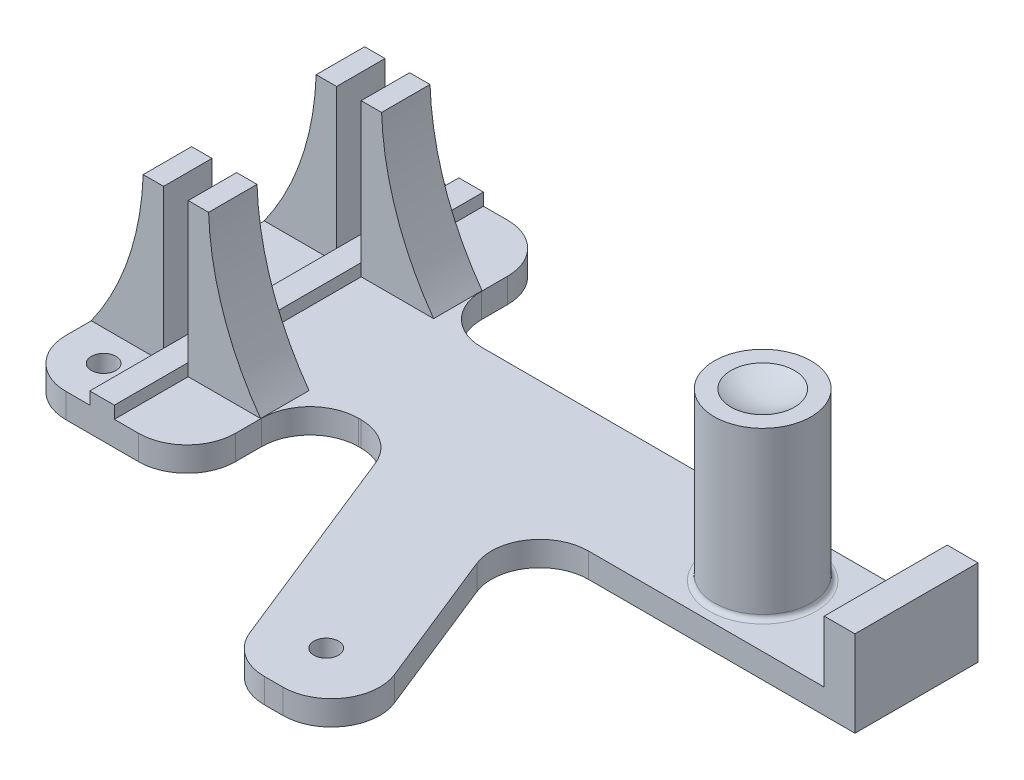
ISO-10303-21;
HEADER;
FILE_DESCRIPTION(('STEP AP214'),'2;1');
FILE_NAME('part.step','',(''),(''),'','','');
FILE_SCHEMA(('AUTOMOTIVE_DESIGN { 1 0 10303 214 1 1 1 1 }'));
ENDSEC;
DATA;
#1=APPLICATION_CONTEXT('core data for automotive mechanical design processes');
#2=APPLICATION_PROTOCOL_DEFINITION('international standard','automotive_design',2000,#1);
#3=PRODUCT_CONTEXT('',#1,'mechanical');
#4=PRODUCT('Part','Part','',(#3));
#5=PRODUCT_RELATED_PRODUCT_CATEGORY('part','',(#4));
#6=PRODUCT_DEFINITION_FORMATION('','',#4);
#7=PRODUCT_DEFINITION_CONTEXT('part definition',#1,'design');
#8=PRODUCT_DEFINITION('design','',#6,#7);
#9=PRODUCT_DEFINITION_SHAPE('','',#8);
#10=(LENGTH_UNIT() NAMED_UNIT(*) SI_UNIT(.MILLI.,.METRE.));
#11=(NAMED_UNIT(*) PLANE_ANGLE_UNIT() SI_UNIT($,.RADIAN.));
#12=(NAMED_UNIT(*) SI_UNIT($,.STERADIAN.) SOLID_ANGLE_UNIT());
#13=UNCERTAINTY_MEASURE_WITH_UNIT(LENGTH_MEASURE(1.E-05),#10,'distance_accuracy_value','');
#14=(GEOMETRIC_REPRESENTATION_CONTEXT(3) GLOBAL_UNCERTAINTY_ASSIGNED_CONTEXT((#13)) GLOBAL_UNIT_ASSIGNED_CONTEXT((#10,
#11,#12)) REPRESENTATION_CONTEXT('',''));
#15=CARTESIAN_POINT('',(0.,0.,0.));
#16=DIRECTION('',(0.,0.,1.));
#17=DIRECTION('',(1.,0.,0.));
#18=AXIS2_PLACEMENT_3D('',#15,#16,#17);
#19=CARTESIAN_POINT('',(30.08,0.,22.7));
#20=DIRECTION('',(0.,1.,0.));
#21=DIRECTION('',(0.,0.,1.));
#22=AXIS2_PLACEMENT_3D('',#19,#20,#21);
#23=PLANE('',#22);
#24=CARTESIAN_POINT('',(-6.03,0.,29.21));
#25=DIRECTION('',(0.,1.,0.));
#26=DIRECTION('',(0.,0.,1.));
#27=AXIS2_PLACEMENT_3D('',#24,#25,#26);
#28=CIRCLE('',#27,2.54);
#29=CARTESIAN_POINT('',(-6.03,0.,31.75));
#30=VERTEX_POINT('',#29);
#31=EDGE_CURVE('E408',#30,#30,#28,.F.);
#32=ORIENTED_EDGE('',*,*,#31,.T.);
#33=EDGE_LOOP('',(#32));
#34=FACE_BOUND('',#33,.T.);
#35=DIRECTION('',(1.,0.,0.));
#36=VECTOR('',#35,1.);
#37=CARTESIAN_POINT('',(-4.92,0.,38.1));
#38=LINE('',#37,#36);
#39=CARTESIAN_POINT('',(-4.92,0.,38.1));
#40=VERTEX_POINT('',#39);
#41=CARTESIAN_POINT('',(0.,0.,38.1));
#42=VERTEX_POINT('',#41);
#43=EDGE_CURVE('E56',#40,#42,#38,.T.);
#44=ORIENTED_EDGE('',*,*,#43,.T.);
#45=DIRECTION('',(0.,0.,1.));
#46=VECTOR('',#45,1.);
#47=CARTESIAN_POINT('',(0.,0.,-38.1));
#48=LINE('',#47,#46);
#49=CARTESIAN_POINT('',(0.,0.,22.86));
#50=VERTEX_POINT('',#49);
#51=EDGE_CURVE('E378',#50,#42,#48,.T.);
#52=ORIENTED_EDGE('',*,*,#51,.F.);
#53=DIRECTION('',(1.,0.,0.));
#54=VECTOR('',#53,1.);
#55=CARTESIAN_POINT('',(0.,0.,22.86));
#56=LINE('',#55,#54);
#57=CARTESIAN_POINT('',(-14.92,0.,22.86));
#58=VERTEX_POINT('',#57);
#59=EDGE_CURVE('E597',#58,#50,#56,.T.);
#60=ORIENTED_EDGE('',*,*,#59,.F.);
#61=DIRECTION('',(0.,0.,1.));
#62=VECTOR('',#61,1.);
#63=CARTESIAN_POINT('',(-14.92,0.,-28.1));
#64=LINE('',#63,#62);
#65=CARTESIAN_POINT('',(-14.92,0.,28.1));
#66=VERTEX_POINT('',#65);
#67=EDGE_CURVE('E663',#58,#66,#64,.T.);
#68=ORIENTED_EDGE('',*,*,#67,.T.);
#69=CARTESIAN_POINT('',(-4.92,0.,28.1));
#70=DIRECTION('',(0.,1.,0.));
#71=DIRECTION('',(0.,0.,1.));
#72=AXIS2_PLACEMENT_3D('',#69,#70,#71);
#73=CIRCLE('',#72,10.);
#74=EDGE_CURVE('E667',#66,#40,#73,.T.);
#75=ORIENTED_EDGE('',*,*,#74,.T.);
#76=EDGE_LOOP('',(#44,#52,#60,#68,#75));
#77=FACE_BOUND('',#76,.T.);
#78=ADVANCED_FACE('F33',(#34,#77),#23,.T.);
#79=DIRECTION('',(1.,0.,0.));
#80=VECTOR('',#79,1.);
#81=CARTESIAN_POINT('',(0.,0.,12.86));
#82=LINE('',#81,#80);
#83=CARTESIAN_POINT('',(-14.92,0.,12.86));
#84=VERTEX_POINT('',#83);
#85=CARTESIAN_POINT('',(0.,0.,12.86));
#86=VERTEX_POINT('',#85);
#87=EDGE_CURVE('E584',#84,#86,#82,.T.);
#88=ORIENTED_EDGE('',*,*,#87,.T.);
#89=CARTESIAN_POINT('',(0.,0.,-12.86));
#90=VERTEX_POINT('',#89);
#91=EDGE_CURVE('E1287',#90,#86,#48,.T.);
#92=ORIENTED_EDGE('',*,*,#91,.F.);
#93=DIRECTION('',(1.,0.,0.));
#94=VECTOR('',#93,1.);
#95=CARTESIAN_POINT('',(0.,0.,-12.86));
#96=LINE('',#95,#94);
#97=CARTESIAN_POINT('',(-14.92,0.,-12.86));
#98=VERTEX_POINT('',#97);
#99=EDGE_CURVE('E511',#98,#90,#96,.T.);
#100=ORIENTED_EDGE('',*,*,#99,.F.);
#101=EDGE_CURVE('E669',#98,#84,#64,.T.);
#102=ORIENTED_EDGE('',*,*,#101,.T.);
#103=EDGE_LOOP('',(#88,#92,#100,#102));
#104=FACE_BOUND('',#103,.T.);
#105=ADVANCED_FACE('F851',(#104),#23,.T.);
#106=CARTESIAN_POINT('',(-6.03,0.,-29.21));
#107=DIRECTION('',(0.,1.,0.));
#108=DIRECTION('',(0.,0.,1.));
#109=AXIS2_PLACEMENT_3D('',#106,#107,#108);
#110=CIRCLE('',#109,2.54);
#111=CARTESIAN_POINT('',(-6.03,0.,-26.67));
#112=VERTEX_POINT('',#111);
#113=EDGE_CURVE('E402',#112,#112,#110,.F.);
#114=ORIENTED_EDGE('',*,*,#113,.T.);
#115=EDGE_LOOP('',(#114));
#116=FACE_BOUND('',#115,.T.);
#117=DIRECTION('',(1.,0.,0.));
#118=VECTOR('',#117,1.);
#119=CARTESIAN_POINT('',(0.,0.,-22.86));
#120=LINE('',#119,#118);
#121=CARTESIAN_POINT('',(-14.92,0.,-22.86));
#122=VERTEX_POINT('',#121);
#123=CARTESIAN_POINT('',(0.,0.,-22.86));
#124=VERTEX_POINT('',#123);
#125=EDGE_CURVE('E524',#122,#124,#120,.T.);
#126=ORIENTED_EDGE('',*,*,#125,.T.);
#127=CARTESIAN_POINT('',(0.,0.,-38.1));
#128=VERTEX_POINT('',#127);
#129=EDGE_CURVE('E1284',#128,#124,#48,.T.);
#130=ORIENTED_EDGE('',*,*,#129,.F.);
#131=DIRECTION('',(-1.,0.,0.));
#132=VECTOR('',#131,1.);
#133=CARTESIAN_POINT('',(-4.92,0.,-38.1));
#134=LINE('',#133,#132);
#135=CARTESIAN_POINT('',(-4.91999999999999,0.,-38.1));
#136=VERTEX_POINT('',#135);
#137=EDGE_CURVE('E657',#128,#136,#134,.T.);
#138=ORIENTED_EDGE('',*,*,#137,.T.);
#139=CARTESIAN_POINT('',(-4.92,0.,-28.1));
#140=DIRECTION('',(0.,1.,0.));
#141=DIRECTION('',(0.,0.,1.));
#142=AXIS2_PLACEMENT_3D('',#139,#140,#141);
#143=CIRCLE('',#142,10.);
#144=CARTESIAN_POINT('',(-14.92,0.,-28.1));
#145=VERTEX_POINT('',#144);
#146=EDGE_CURVE('E660',#136,#145,#143,.T.);
#147=ORIENTED_EDGE('',*,*,#146,.T.);
#148=EDGE_CURVE('E664',#145,#122,#64,.T.);
#149=ORIENTED_EDGE('',*,*,#148,.T.);
#150=EDGE_LOOP('',(#126,#130,#138,#147,#149));
#151=FACE_BOUND('',#150,.T.);
#152=ADVANCED_FACE('F857',(#116,#151),#23,.T.);
#153=CARTESIAN_POINT('',(100.84,0.,0.));
#154=DIRECTION('',(0.,1.,0.));
#155=DIRECTION('',(0.,0.,1.));
#156=AXIS2_PLACEMENT_3D('',#153,#154,#155);
#157=CIRCLE('',#156,11.);
#158=CARTESIAN_POINT('',(100.84,0.,11.));
#159=VERTEX_POINT('',#158);
#160=EDGE_CURVE('E721',#159,#159,#157,.F.);
#161=ORIENTED_EDGE('',*,*,#160,.T.);
#162=EDGE_LOOP('',(#161));
#163=FACE_BOUND('',#162,.T.);
#164=CARTESIAN_POINT('',(67.8645239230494,0.,57.15));
#165=DIRECTION('',(0.,1.,0.));
#166=DIRECTION('',(0.,0.,1.));
#167=AXIS2_PLACEMENT_3D('',#164,#165,#166);
#168=CIRCLE('',#167,2.54);
#169=CARTESIAN_POINT('',(67.8645239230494,0.,59.69));
#170=VERTEX_POINT('',#169);
#171=EDGE_CURVE('E396',#170,#170,#168,.F.);
#172=ORIENTED_EDGE('',*,*,#171,.T.);
#173=EDGE_LOOP('',(#172));
#174=FACE_BOUND('',#173,.T.);
#175=CARTESIAN_POINT('',(118.62,0.,0.));
#176=DIRECTION('',(0.,1.,0.));
#177=DIRECTION('',(0.,0.,1.));
#178=AXIS2_PLACEMENT_3D('',#175,#176,#177);
#179=CIRCLE('',#178,2.54);
#180=CARTESIAN_POINT('',(118.62,0.,2.54));
#181=VERTEX_POINT('',#180);
#182=EDGE_CURVE('E392',#181,#181,#179,.F.);
#183=ORIENTED_EDGE('',*,*,#182,.T.);
#184=EDGE_LOOP('',(#183));
#185=FACE_BOUND('',#184,.T.);
#186=CARTESIAN_POINT('',(10.08,0.,-38.1));
#187=VERTEX_POINT('',#186);
#188=CARTESIAN_POINT('',(5.08000000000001,0.,-38.1));
#189=VERTEX_POINT('',#188);
#190=EDGE_CURVE('E658',#187,#189,#134,.T.);
#191=ORIENTED_EDGE('',*,*,#190,.T.);
#192=DIRECTION('',(0.,0.,-1.));
#193=VECTOR('',#192,1.);
#194=CARTESIAN_POINT('',(5.08,0.,-38.1));
#195=LINE('',#194,#193);
#196=CARTESIAN_POINT('',(5.08000000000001,0.,-22.86));
#197=VERTEX_POINT('',#196);
#198=EDGE_CURVE('E1257',#197,#189,#195,.T.);
#199=ORIENTED_EDGE('',*,*,#198,.F.);
#200=DIRECTION('',(1.,0.,0.));
#201=VECTOR('',#200,1.);
#202=CARTESIAN_POINT('',(5.08,0.,-22.86));
#203=LINE('',#202,#201);
#204=CARTESIAN_POINT('',(20.033299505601,0.,-22.86));
#205=VERTEX_POINT('',#204);
#206=EDGE_CURVE('E483',#197,#205,#203,.T.);
#207=ORIENTED_EDGE('',*,*,#206,.T.);
#208=DIRECTION('',(0.,0.,-1.));
#209=VECTOR('',#208,1.);
#210=CARTESIAN_POINT('',(20.033299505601,0.,-12.86));
#211=LINE('',#210,#209);
#212=CARTESIAN_POINT('',(20.033299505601,0.,-12.86));
#213=VERTEX_POINT('',#212);
#214=EDGE_CURVE('E499',#213,#205,#211,.T.);
#215=ORIENTED_EDGE('',*,*,#214,.F.);
#216=DIRECTION('',(1.,0.,0.));
#217=VECTOR('',#216,1.);
#218=CARTESIAN_POINT('',(5.08,0.,-12.86));
#219=LINE('',#218,#217);
#220=CARTESIAN_POINT('',(5.08,0.,-12.86));
#221=VERTEX_POINT('',#220);
#222=EDGE_CURVE('E487',#221,#213,#219,.T.);
#223=ORIENTED_EDGE('',*,*,#222,.F.);
#224=CARTESIAN_POINT('',(5.08,0.,12.86));
#225=VERTEX_POINT('',#224);
#226=EDGE_CURVE('E1276',#225,#221,#195,.T.);
#227=ORIENTED_EDGE('',*,*,#226,.F.);
#228=DIRECTION('',(1.,0.,0.));
#229=VECTOR('',#228,1.);
#230=CARTESIAN_POINT('',(5.08,0.,12.86));
#231=LINE('',#230,#229);
#232=CARTESIAN_POINT('',(20.033299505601,0.,12.86));
#233=VERTEX_POINT('',#232);
#234=EDGE_CURVE('E544',#225,#233,#231,.T.);
#235=ORIENTED_EDGE('',*,*,#234,.T.);
#236=DIRECTION('',(0.,0.,1.));
#237=VECTOR('',#236,1.);
#238=CARTESIAN_POINT('',(20.033299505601,0.,12.86));
#239=LINE('',#238,#237);
#240=CARTESIAN_POINT('',(20.033299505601,0.,22.86));
#241=VERTEX_POINT('',#240);
#242=EDGE_CURVE('E553',#233,#241,#239,.T.);
#243=ORIENTED_EDGE('',*,*,#242,.T.);
#244=DIRECTION('',(1.,0.,0.));
#245=VECTOR('',#244,1.);
#246=CARTESIAN_POINT('',(5.08,0.,22.86));
#247=LINE('',#246,#245);
#248=CARTESIAN_POINT('',(5.08,0.,22.86));
#249=VERTEX_POINT('',#248);
#250=EDGE_CURVE('E556',#249,#241,#247,.T.);
#251=ORIENTED_EDGE('',*,*,#250,.F.);
#252=CARTESIAN_POINT('',(5.08000000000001,0.,38.1));
#253=VERTEX_POINT('',#252);
#254=EDGE_CURVE('E48',#253,#249,#195,.T.);
#255=ORIENTED_EDGE('',*,*,#254,.F.);
#256=CARTESIAN_POINT('',(10.08,0.,38.1));
#257=VERTEX_POINT('',#256);
#258=EDGE_CURVE('E672',#253,#257,#38,.T.);
#259=ORIENTED_EDGE('',*,*,#258,.T.);
#260=CARTESIAN_POINT('',(10.08,0.,28.1));
#261=DIRECTION('',(0.,1.,0.));
#262=DIRECTION('',(0.,0.,-1.));
#263=AXIS2_PLACEMENT_3D('',#260,#261,#262);
#264=CIRCLE('',#263,10.);
#265=CARTESIAN_POINT('',(20.08,0.,28.1));
#266=VERTEX_POINT('',#265);
#267=EDGE_CURVE('E674',#257,#266,#264,.T.);
#268=ORIENTED_EDGE('',*,*,#267,.T.);
#269=DIRECTION('',(0.,0.,-1.));
#270=VECTOR('',#269,1.);
#271=CARTESIAN_POINT('',(20.08,0.,28.1));
#272=LINE('',#271,#270);
#273=CARTESIAN_POINT('',(20.08,0.,22.7));
#274=VERTEX_POINT('',#273);
#275=EDGE_CURVE('E677',#266,#274,#272,.T.);
#276=ORIENTED_EDGE('',*,*,#275,.T.);
#277=CARTESIAN_POINT('',(30.08,0.,22.7));
#278=DIRECTION('',(0.,-1.,0.));
#279=DIRECTION('',(0.,0.,1.));
#280=AXIS2_PLACEMENT_3D('',#277,#278,#279);
#281=CIRCLE('',#280,10.);
#282=CARTESIAN_POINT('',(30.08,0.,12.7));
#283=VERTEX_POINT('',#282);
#284=EDGE_CURVE('E680',#274,#283,#281,.T.);
#285=ORIENTED_EDGE('',*,*,#284,.T.);
#286=DIRECTION('',(1.,0.,0.));
#287=VECTOR('',#286,1.);
#288=CARTESIAN_POINT('',(30.08,0.,12.7));
#289=LINE('',#288,#287);
#290=CARTESIAN_POINT('',(30.5759629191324,0.,12.7));
#291=VERTEX_POINT('',#290);
#292=EDGE_CURVE('E684',#283,#291,#289,.T.);
#293=ORIENTED_EDGE('',*,*,#292,.T.);
#294=CARTESIAN_POINT('',(30.5759629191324,0.,22.7));
#295=DIRECTION('',(0.,1.,0.));
#296=DIRECTION('',(0.,0.,1.));
#297=AXIS2_PLACEMENT_3D('',#294,#295,#296);
#298=CIRCLE('',#297,10.);
#299=CARTESIAN_POINT('',(39.8575205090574,0.,18.9780799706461));
#300=VERTEX_POINT('',#299);
#301=EDGE_CURVE('E41',#291,#300,#298,.F.);
#302=ORIENTED_EDGE('',*,*,#301,.T.);
#303=DIRECTION('',(0.372192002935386,0.,0.928155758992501));
#304=VECTOR('',#303,1.);
#305=CARTESIAN_POINT('',(37.34,0.,12.7));
#306=LINE('',#305,#304);
#307=CARTESIAN_POINT('',(57.2304524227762,0.,62.3019200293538));
#308=VERTEX_POINT('',#307);
#309=EDGE_CURVE('E414',#300,#308,#306,.T.);
#310=ORIENTED_EDGE('',*,*,#309,.T.);
#311=CARTESIAN_POINT('',(66.5120100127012,0.,58.58));
#312=DIRECTION('',(0.,1.,0.));
#313=DIRECTION('',(0.,0.,1.));
#314=AXIS2_PLACEMENT_3D('',#311,#312,#313);
#315=CIRCLE('',#314,10.);
#316=CARTESIAN_POINT('',(66.5120100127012,0.,68.58));
#317=VERTEX_POINT('',#316);
#318=EDGE_CURVE('E434',#308,#317,#315,.T.);
#319=ORIENTED_EDGE('',*,*,#318,.T.);
#320=DIRECTION('',(1.,0.,0.));
#321=VECTOR('',#320,1.);
#322=CARTESIAN_POINT('',(70.3639025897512,0.,68.58));
#323=LINE('',#322,#321);
#324=CARTESIAN_POINT('',(70.3639025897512,0.,68.58));
#325=VERTEX_POINT('',#324);
#326=EDGE_CURVE('E437',#317,#325,#323,.T.);
#327=ORIENTED_EDGE('',*,*,#326,.T.);
#328=CARTESIAN_POINT('',(70.3639025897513,0.,58.58));
#329=DIRECTION('',(0.,1.,0.));
#330=DIRECTION('',(0.,0.,-1.));
#331=AXIS2_PLACEMENT_3D('',#328,#329,#330);
#332=CIRCLE('',#331,10.);
#333=CARTESIAN_POINT('',(79.6454601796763,0.,54.858079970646));
#334=VERTEX_POINT('',#333);
#335=EDGE_CURVE('E440',#325,#334,#332,.T.);
#336=ORIENTED_EDGE('',*,*,#335,.T.);
#337=DIRECTION('',(-0.372192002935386,0.,-0.928155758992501));
#338=VECTOR('',#337,1.);
#339=CARTESIAN_POINT('',(62.74,0.,12.7));
#340=LINE('',#339,#338);
#341=CARTESIAN_POINT('',(68.2425127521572,0.,26.4219200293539));
#342=VERTEX_POINT('',#341);
#343=EDGE_CURVE('E420',#334,#342,#340,.T.);
#344=ORIENTED_EDGE('',*,*,#343,.T.);
#345=CARTESIAN_POINT('',(77.5240703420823,0.,22.7));
#346=DIRECTION('',(0.,1.,0.));
#347=DIRECTION('',(0.,0.,1.));
#348=AXIS2_PLACEMENT_3D('',#345,#346,#347);
#349=CIRCLE('',#348,10.);
#350=CARTESIAN_POINT('',(77.5240703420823,0.,12.7));
#351=VERTEX_POINT('',#350);
#352=EDGE_CURVE('E729',#342,#351,#349,.F.);
#353=ORIENTED_EDGE('',*,*,#352,.T.);
#354=CARTESIAN_POINT('',(126.24,0.,12.7));
#355=VERTEX_POINT('',#354);
#356=EDGE_CURVE('E683',#351,#355,#289,.T.);
#357=ORIENTED_EDGE('',*,*,#356,.T.);
#358=DIRECTION('',(0.,0.,1.));
#359=VECTOR('',#358,1.);
#360=CARTESIAN_POINT('',(126.24,0.,12.7));
#361=LINE('',#360,#359);
#362=CARTESIAN_POINT('',(126.24,0.,-12.7));
#363=VERTEX_POINT('',#362);
#364=EDGE_CURVE('E447',#363,#355,#361,.T.);
#365=ORIENTED_EDGE('',*,*,#364,.F.);
#366=DIRECTION('',(-1.,0.,0.));
#367=VECTOR('',#366,1.);
#368=CARTESIAN_POINT('',(30.08,0.,-12.7));
#369=LINE('',#368,#367);
#370=CARTESIAN_POINT('',(30.08,0.,-12.7));
#371=VERTEX_POINT('',#370);
#372=EDGE_CURVE('E600',#363,#371,#369,.T.);
#373=ORIENTED_EDGE('',*,*,#372,.T.);
#374=CARTESIAN_POINT('',(30.08,0.,-22.7));
#375=DIRECTION('',(0.,-1.,0.));
#376=DIRECTION('',(0.,0.,1.));
#377=AXIS2_PLACEMENT_3D('',#374,#375,#376);
#378=CIRCLE('',#377,10.);
#379=CARTESIAN_POINT('',(20.08,0.,-22.7));
#380=VERTEX_POINT('',#379);
#381=EDGE_CURVE('E648',#371,#380,#378,.T.);
#382=ORIENTED_EDGE('',*,*,#381,.T.);
#383=DIRECTION('',(0.,0.,-1.));
#384=VECTOR('',#383,1.);
#385=CARTESIAN_POINT('',(20.08,0.,-28.1));
#386=LINE('',#385,#384);
#387=CARTESIAN_POINT('',(20.08,0.,-28.1));
#388=VERTEX_POINT('',#387);
#389=EDGE_CURVE('E651',#380,#388,#386,.T.);
#390=ORIENTED_EDGE('',*,*,#389,.T.);
#391=CARTESIAN_POINT('',(10.08,0.,-28.1));
#392=DIRECTION('',(0.,1.,0.));
#393=DIRECTION('',(0.,0.,1.));
#394=AXIS2_PLACEMENT_3D('',#391,#392,#393);
#395=CIRCLE('',#394,10.);
#396=EDGE_CURVE('E654',#388,#187,#395,.T.);
#397=ORIENTED_EDGE('',*,*,#396,.T.);
#398=EDGE_LOOP('',(#191,#199,#207,#215,#223,#227,#235,#243,#251,#255,#259,#268,#276,#285,#293,
#302,#310,#319,#327,#336,#344,#353,#357,#365,#373,#382,#390,#397));
#399=FACE_BOUND('',#398,.T.);
#400=ADVANCED_FACE('F738',(#163,#174,#185,#399),#23,.T.);
#401=CARTESIAN_POINT('',(30.08,-5.08,12.7));
#402=DIRECTION('',(0.,0.,1.));
#403=DIRECTION('',(1.,0.,0.));
#404=AXIS2_PLACEMENT_3D('',#401,#402,#403);
#405=PLANE('',#404);
#406=ORIENTED_EDGE('',*,*,#356,.F.);
#407=DIRECTION('',(0.,1.,0.));
#408=VECTOR('',#407,1.);
#409=CARTESIAN_POINT('',(77.5240703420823,-5.08,12.7));
#410=LINE('',#409,#408);
#411=CARTESIAN_POINT('',(77.5240703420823,-5.08,12.7));
#412=VERTEX_POINT('',#411);
#413=EDGE_CURVE('E727',#351,#412,#410,.F.);
#414=ORIENTED_EDGE('',*,*,#413,.T.);
#415=DIRECTION('',(1.,0.,0.));
#416=VECTOR('',#415,1.);
#417=CARTESIAN_POINT('',(132.59,-5.08,12.7));
#418=LINE('',#417,#416);
#419=CARTESIAN_POINT('',(132.59,-5.08,12.7));
#420=VERTEX_POINT('',#419);
#421=EDGE_CURVE('E609',#412,#420,#418,.T.);
#422=ORIENTED_EDGE('',*,*,#421,.T.);
#423=DIRECTION('',(0.,1.,0.));
#424=VECTOR('',#423,1.);
#425=CARTESIAN_POINT('',(132.59,-5.08,12.7));
#426=LINE('',#425,#424);
#427=CARTESIAN_POINT('',(132.59,12.7,12.7));
#428=VERTEX_POINT('',#427);
#429=EDGE_CURVE('E646',#420,#428,#426,.T.);
#430=ORIENTED_EDGE('',*,*,#429,.T.);
#431=DIRECTION('',(1.,0.,0.));
#432=VECTOR('',#431,1.);
#433=CARTESIAN_POINT('',(132.59,12.7,12.7));
#434=LINE('',#433,#432);
#435=CARTESIAN_POINT('',(126.24,12.7,12.7));
#436=VERTEX_POINT('',#435);
#437=EDGE_CURVE('E461',#436,#428,#434,.T.);
#438=ORIENTED_EDGE('',*,*,#437,.F.);
#439=DIRECTION('',(0.,-1.,0.));
#440=VECTOR('',#439,1.);
#441=CARTESIAN_POINT('',(126.24,12.7,12.7));
#442=LINE('',#441,#440);
#443=EDGE_CURVE('E464',#436,#355,#442,.T.);
#444=ORIENTED_EDGE('',*,*,#443,.T.);
#445=EDGE_LOOP('',(#406,#414,#422,#430,#438,#444));
#446=FACE_BOUND('',#445,.T.);
#447=ADVANCED_FACE('F816',(#446),#405,.T.);
#448=CARTESIAN_POINT('',(30.08,-5.08,12.7));
#449=VERTEX_POINT('',#448);
#450=CARTESIAN_POINT('',(30.5759629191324,-5.08,12.7));
#451=VERTEX_POINT('',#450);
#452=EDGE_CURVE('E605',#449,#451,#418,.T.);
#453=ORIENTED_EDGE('',*,*,#452,.T.);
#454=DIRECTION('',(0.,1.,0.));
#455=VECTOR('',#454,1.);
#456=CARTESIAN_POINT('',(30.5759629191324,0.,12.7));
#457=LINE('',#456,#455);
#458=EDGE_CURVE('E733',#451,#291,#457,.T.);
#459=ORIENTED_EDGE('',*,*,#458,.T.);
#460=ORIENTED_EDGE('',*,*,#292,.F.);
#461=DIRECTION('',(0.,1.,0.));
#462=VECTOR('',#461,1.);
#463=CARTESIAN_POINT('',(30.08,-5.08,12.7));
#464=LINE('',#463,#462);
#465=EDGE_CURVE('E687',#449,#283,#464,.T.);
#466=ORIENTED_EDGE('',*,*,#465,.F.);
#467=EDGE_LOOP('',(#453,#459,#460,#466));
#468=FACE_BOUND('',#467,.T.);
#469=ADVANCED_FACE('F755',(#468),#405,.T.);
#470=CARTESIAN_POINT('',(30.08,-5.08,22.7));
#471=DIRECTION('',(0.,1.,0.));
#472=DIRECTION('',(0.,0.,1.));
#473=AXIS2_PLACEMENT_3D('',#470,#471,#472);
#474=CYLINDRICAL_SURFACE('',#473,10.);
#475=ORIENTED_EDGE('',*,*,#284,.F.);
#476=DIRECTION('',(0.,1.,0.));
#477=VECTOR('',#476,1.);
#478=CARTESIAN_POINT('',(20.08,-5.08,22.7));
#479=LINE('',#478,#477);
#480=CARTESIAN_POINT('',(20.08,-5.08,22.7));
#481=VERTEX_POINT('',#480);
#482=EDGE_CURVE('E689',#481,#274,#479,.T.);
#483=ORIENTED_EDGE('',*,*,#482,.F.);
#484=CARTESIAN_POINT('',(30.08,-5.08,22.7));
#485=DIRECTION('',(0.,-1.,0.));
#486=DIRECTION('',(0.,0.,1.));
#487=AXIS2_PLACEMENT_3D('',#484,#485,#486);
#488=CIRCLE('',#487,10.);
#489=EDGE_CURVE('E643',#481,#449,#488,.T.);
#490=ORIENTED_EDGE('',*,*,#489,.T.);
#491=ORIENTED_EDGE('',*,*,#465,.T.);
#492=EDGE_LOOP('',(#475,#483,#490,#491));
#493=FACE_BOUND('',#492,.T.);
#494=ADVANCED_FACE('F758',(#493),#474,.F.);
#495=CARTESIAN_POINT('',(20.08,-5.08,28.1));
#496=DIRECTION('',(1.,0.,0.));
#497=DIRECTION('',(0.,0.,-1.));
#498=AXIS2_PLACEMENT_3D('',#495,#496,#497);
#499=PLANE('',#498);
#500=ORIENTED_EDGE('',*,*,#275,.F.);
#501=DIRECTION('',(0.,1.,0.));
#502=VECTOR('',#501,1.);
#503=CARTESIAN_POINT('',(20.08,-5.08,28.1));
#504=LINE('',#503,#502);
#505=CARTESIAN_POINT('',(20.08,-5.08,28.1));
#506=VERTEX_POINT('',#505);
#507=EDGE_CURVE('E691',#506,#266,#504,.T.);
#508=ORIENTED_EDGE('',*,*,#507,.F.);
#509=DIRECTION('',(0.,0.,-1.));
#510=VECTOR('',#509,1.);
#511=CARTESIAN_POINT('',(20.08,-5.08,28.1));
#512=LINE('',#511,#510);
#513=EDGE_CURVE('E640',#506,#481,#512,.T.);
#514=ORIENTED_EDGE('',*,*,#513,.T.);
#515=ORIENTED_EDGE('',*,*,#482,.T.);
#516=EDGE_LOOP('',(#500,#508,#514,#515));
#517=FACE_BOUND('',#516,.T.);
#518=ADVANCED_FACE('F763',(#517),#499,.T.);
#519=CARTESIAN_POINT('',(10.08,-5.08,28.1));
#520=DIRECTION('',(0.,1.,0.));
#521=DIRECTION('',(0.,0.,1.));
#522=AXIS2_PLACEMENT_3D('',#519,#520,#521);
#523=CYLINDRICAL_SURFACE('',#522,10.);
#524=ORIENTED_EDGE('',*,*,#267,.F.);
#525=DIRECTION('',(0.,1.,0.));
#526=VECTOR('',#525,1.);
#527=CARTESIAN_POINT('',(10.08,-5.08,38.1));
#528=LINE('',#527,#526);
#529=CARTESIAN_POINT('',(10.08,-5.08,38.1));
#530=VERTEX_POINT('',#529);
#531=EDGE_CURVE('E693',#530,#257,#528,.T.);
#532=ORIENTED_EDGE('',*,*,#531,.F.);
#533=CARTESIAN_POINT('',(10.08,-5.08,28.1));
#534=DIRECTION('',(0.,1.,0.));
#535=DIRECTION('',(0.,0.,-1.));
#536=AXIS2_PLACEMENT_3D('',#533,#534,#535);
#537=CIRCLE('',#536,10.);
#538=EDGE_CURVE('E637',#530,#506,#537,.T.);
#539=ORIENTED_EDGE('',*,*,#538,.T.);
#540=ORIENTED_EDGE('',*,*,#507,.T.);
#541=EDGE_LOOP('',(#524,#532,#539,#540));
#542=FACE_BOUND('',#541,.T.);
#543=ADVANCED_FACE('F766',(#542),#523,.T.);
#544=CARTESIAN_POINT('',(-4.92,-5.08,38.1));
#545=DIRECTION('',(0.,0.,1.));
#546=DIRECTION('',(1.,0.,0.));
#547=AXIS2_PLACEMENT_3D('',#544,#545,#546);
#548=PLANE('',#547);
#549=ORIENTED_EDGE('',*,*,#43,.F.);
#550=DIRECTION('',(0.,1.,0.));
#551=VECTOR('',#550,1.);
#552=CARTESIAN_POINT('',(-4.92,-5.08,38.1));
#553=LINE('',#552,#551);
#554=CARTESIAN_POINT('',(-4.92,-5.08,38.1));
#555=VERTEX_POINT('',#554);
#556=EDGE_CURVE('E696',#555,#40,#553,.T.);
#557=ORIENTED_EDGE('',*,*,#556,.F.);
#558=DIRECTION('',(1.,0.,0.));
#559=VECTOR('',#558,1.);
#560=CARTESIAN_POINT('',(-4.92,-5.08,38.1));
#561=LINE('',#560,#559);
#562=EDGE_CURVE('E634',#555,#530,#561,.T.);
#563=ORIENTED_EDGE('',*,*,#562,.T.);
#564=ORIENTED_EDGE('',*,*,#531,.T.);
#565=ORIENTED_EDGE('',*,*,#258,.F.);
#566=DIRECTION('',(0.,-1.,0.));
#567=VECTOR('',#566,1.);
#568=CARTESIAN_POINT('',(5.08000000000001,2.54,38.1));
#569=LINE('',#568,#567);
#570=CARTESIAN_POINT('',(5.08000000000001,2.54,38.1));
#571=VERTEX_POINT('',#570);
#572=EDGE_CURVE('E373',#571,#253,#569,.T.);
#573=ORIENTED_EDGE('',*,*,#572,.F.);
#574=DIRECTION('',(1.,0.,0.));
#575=VECTOR('',#574,1.);
#576=CARTESIAN_POINT('',(0.,2.54,38.1));
#577=LINE('',#576,#575);
#578=CARTESIAN_POINT('',(0.,2.54,38.1));
#579=VERTEX_POINT('',#578);
#580=EDGE_CURVE('E359',#579,#571,#577,.T.);
#581=ORIENTED_EDGE('',*,*,#580,.F.);
#582=DIRECTION('',(0.,-1.,0.));
#583=VECTOR('',#582,1.);
#584=CARTESIAN_POINT('',(0.,2.54,38.1));
#585=LINE('',#584,#583);
#586=EDGE_CURVE('E371',#579,#42,#585,.T.);
#587=ORIENTED_EDGE('',*,*,#586,.T.);
#588=EDGE_LOOP('',(#549,#557,#563,#564,#565,#573,#581,#587));
#589=FACE_BOUND('',#588,.T.);
#590=ADVANCED_FACE('F370',(#589),#548,.T.);
#591=CARTESIAN_POINT('',(-4.92,-5.08,28.1));
#592=DIRECTION('',(0.,1.,0.));
#593=DIRECTION('',(0.,0.,1.));
#594=AXIS2_PLACEMENT_3D('',#591,#592,#593);
#595=CYLINDRICAL_SURFACE('',#594,10.);
#596=ORIENTED_EDGE('',*,*,#74,.F.);
#597=DIRECTION('',(0.,1.,0.));
#598=VECTOR('',#597,1.);
#599=CARTESIAN_POINT('',(-14.92,-5.08,28.1));
#600=LINE('',#599,#598);
#601=CARTESIAN_POINT('',(-14.92,-5.08,28.1));
#602=VERTEX_POINT('',#601);
#603=EDGE_CURVE('E698',#602,#66,#600,.T.);
#604=ORIENTED_EDGE('',*,*,#603,.F.);
#605=CARTESIAN_POINT('',(-4.92,-5.08,28.1));
#606=DIRECTION('',(0.,1.,0.));
#607=DIRECTION('',(0.,0.,1.));
#608=AXIS2_PLACEMENT_3D('',#605,#606,#607);
#609=CIRCLE('',#608,10.);
#610=EDGE_CURVE('E631',#602,#555,#609,.T.);
#611=ORIENTED_EDGE('',*,*,#610,.T.);
#612=ORIENTED_EDGE('',*,*,#556,.T.);
#613=EDGE_LOOP('',(#596,#604,#611,#612));
#614=FACE_BOUND('',#613,.T.);
#615=ADVANCED_FACE('F771',(#614),#595,.T.);
#616=CARTESIAN_POINT('',(-14.92,-5.08,-28.1));
#617=DIRECTION('',(-1.,0.,0.));
#618=DIRECTION('',(0.,0.,1.));
#619=AXIS2_PLACEMENT_3D('',#616,#617,#618);
#620=PLANE('',#619);
#621=ORIENTED_EDGE('',*,*,#148,.F.);
#622=DIRECTION('',(0.,1.,0.));
#623=VECTOR('',#622,1.);
#624=CARTESIAN_POINT('',(-14.92,-5.08,-28.1));
#625=LINE('',#624,#623);
#626=CARTESIAN_POINT('',(-14.92,-5.08,-28.1));
#627=VERTEX_POINT('',#626);
#628=EDGE_CURVE('E701',#627,#145,#625,.T.);
#629=ORIENTED_EDGE('',*,*,#628,.F.);
#630=DIRECTION('',(0.,0.,1.));
#631=VECTOR('',#630,1.);
#632=CARTESIAN_POINT('',(-14.92,-5.08,-28.1));
#633=LINE('',#632,#631);
#634=EDGE_CURVE('E628',#627,#602,#633,.T.);
#635=ORIENTED_EDGE('',*,*,#634,.T.);
#636=ORIENTED_EDGE('',*,*,#603,.T.);
#637=ORIENTED_EDGE('',*,*,#67,.F.);
#638=EDGE_CURVE('E670',#84,#58,#64,.T.);
#639=ORIENTED_EDGE('',*,*,#638,.F.);
#640=ORIENTED_EDGE('',*,*,#101,.F.);
#641=EDGE_CURVE('E668',#122,#98,#64,.T.);
#642=ORIENTED_EDGE('',*,*,#641,.F.);
#643=EDGE_LOOP('',(#621,#629,#635,#636,#637,#639,#640,#642));
#644=FACE_BOUND('',#643,.T.);
#645=ADVANCED_FACE('F776',(#644),#620,.T.);
#646=CARTESIAN_POINT('',(-4.92,-5.08,-28.1));
#647=DIRECTION('',(0.,1.,0.));
#648=DIRECTION('',(0.,0.,1.));
#649=AXIS2_PLACEMENT_3D('',#646,#647,#648);
#650=CYLINDRICAL_SURFACE('',#649,10.);
#651=ORIENTED_EDGE('',*,*,#146,.F.);
#652=DIRECTION('',(0.,1.,0.));
#653=VECTOR('',#652,1.);
#654=CARTESIAN_POINT('',(-4.91999999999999,-5.08,-38.1));
#655=LINE('',#654,#653);
#656=CARTESIAN_POINT('',(-4.91999999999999,-5.08,-38.1));
#657=VERTEX_POINT('',#656);
#658=EDGE_CURVE('E703',#657,#136,#655,.T.);
#659=ORIENTED_EDGE('',*,*,#658,.F.);
#660=CARTESIAN_POINT('',(-4.92,-5.08,-28.1));
#661=DIRECTION('',(0.,1.,0.));
#662=DIRECTION('',(0.,0.,1.));
#663=AXIS2_PLACEMENT_3D('',#660,#661,#662);
#664=CIRCLE('',#663,10.);
#665=EDGE_CURVE('E625',#657,#627,#664,.T.);
#666=ORIENTED_EDGE('',*,*,#665,.T.);
#667=ORIENTED_EDGE('',*,*,#628,.T.);
#668=EDGE_LOOP('',(#651,#659,#666,#667));
#669=FACE_BOUND('',#668,.T.);
#670=ADVANCED_FACE('F780',(#669),#650,.T.);
#671=CARTESIAN_POINT('',(-4.92,-5.08,-38.1));
#672=DIRECTION('',(0.,0.,-1.));
#673=DIRECTION('',(-1.,0.,0.));
#674=AXIS2_PLACEMENT_3D('',#671,#672,#673);
#675=PLANE('',#674);
#676=ORIENTED_EDGE('',*,*,#190,.F.);
#677=DIRECTION('',(0.,1.,0.));
#678=VECTOR('',#677,1.);
#679=CARTESIAN_POINT('',(10.08,-5.08,-38.1));
#680=LINE('',#679,#678);
#681=CARTESIAN_POINT('',(10.08,-5.08,-38.1));
#682=VERTEX_POINT('',#681);
#683=EDGE_CURVE('E706',#682,#187,#680,.T.);
#684=ORIENTED_EDGE('',*,*,#683,.F.);
#685=DIRECTION('',(-1.,0.,0.));
#686=VECTOR('',#685,1.);
#687=CARTESIAN_POINT('',(-4.92,-5.08,-38.1));
#688=LINE('',#687,#686);
#689=EDGE_CURVE('E622',#682,#657,#688,.T.);
#690=ORIENTED_EDGE('',*,*,#689,.T.);
#691=ORIENTED_EDGE('',*,*,#658,.T.);
#692=ORIENTED_EDGE('',*,*,#137,.F.);
#693=DIRECTION('',(0.,-1.,0.));
#694=VECTOR('',#693,1.);
#695=CARTESIAN_POINT('',(0.,2.54,-38.1));
#696=LINE('',#695,#694);
#697=CARTESIAN_POINT('',(0.,2.54,-38.1));
#698=VERTEX_POINT('',#697);
#699=EDGE_CURVE('E1283',#698,#128,#696,.T.);
#700=ORIENTED_EDGE('',*,*,#699,.F.);
#701=DIRECTION('',(-1.,0.,0.));
#702=VECTOR('',#701,1.);
#703=CARTESIAN_POINT('',(0.,2.54,-38.1));
#704=LINE('',#703,#702);
#705=CARTESIAN_POINT('',(5.08,2.54,-38.1));
#706=VERTEX_POINT('',#705);
#707=EDGE_CURVE('E1281',#706,#698,#704,.T.);
#708=ORIENTED_EDGE('',*,*,#707,.F.);
#709=DIRECTION('',(0.,-1.,0.));
#710=VECTOR('',#709,1.);
#711=CARTESIAN_POINT('',(5.08,2.54,-38.1));
#712=LINE('',#711,#710);
#713=EDGE_CURVE('E384',#706,#189,#712,.T.);
#714=ORIENTED_EDGE('',*,*,#713,.T.);
#715=EDGE_LOOP('',(#676,#684,#690,#691,#692,#700,#708,#714));
#716=FACE_BOUND('',#715,.T.);
#717=ADVANCED_FACE('F785',(#716),#675,.T.);
#718=CARTESIAN_POINT('',(10.08,-5.08,-28.1));
#719=DIRECTION('',(0.,1.,0.));
#720=DIRECTION('',(0.,0.,1.));
#721=AXIS2_PLACEMENT_3D('',#718,#719,#720);
#722=CYLINDRICAL_SURFACE('',#721,10.);
#723=ORIENTED_EDGE('',*,*,#396,.F.);
#724=DIRECTION('',(0.,1.,0.));
#725=VECTOR('',#724,1.);
#726=CARTESIAN_POINT('',(20.08,-5.08,-28.1));
#727=LINE('',#726,#725);
#728=CARTESIAN_POINT('',(20.08,-5.08,-28.1));
#729=VERTEX_POINT('',#728);
#730=EDGE_CURVE('E708',#729,#388,#727,.T.);
#731=ORIENTED_EDGE('',*,*,#730,.F.);
#732=CARTESIAN_POINT('',(10.08,-5.08,-28.1));
#733=DIRECTION('',(0.,1.,0.));
#734=DIRECTION('',(0.,0.,1.));
#735=AXIS2_PLACEMENT_3D('',#732,#733,#734);
#736=CIRCLE('',#735,10.);
#737=EDGE_CURVE('E619',#729,#682,#736,.T.);
#738=ORIENTED_EDGE('',*,*,#737,.T.);
#739=ORIENTED_EDGE('',*,*,#683,.T.);
#740=EDGE_LOOP('',(#723,#731,#738,#739));
#741=FACE_BOUND('',#740,.T.);
#742=ADVANCED_FACE('F790',(#741),#722,.T.);
#743=CARTESIAN_POINT('',(20.08,-5.08,-28.1));
#744=DIRECTION('',(1.,0.,0.));
#745=DIRECTION('',(0.,0.,-1.));
#746=AXIS2_PLACEMENT_3D('',#743,#744,#745);
#747=PLANE('',#746);
#748=ORIENTED_EDGE('',*,*,#389,.F.);
#749=DIRECTION('',(0.,1.,0.));
#750=VECTOR('',#749,1.);
#751=CARTESIAN_POINT('',(20.08,-5.08,-22.7));
#752=LINE('',#751,#750);
#753=CARTESIAN_POINT('',(20.08,-5.08,-22.7));
#754=VERTEX_POINT('',#753);
#755=EDGE_CURVE('E710',#754,#380,#752,.T.);
#756=ORIENTED_EDGE('',*,*,#755,.F.);
#757=DIRECTION('',(0.,0.,-1.));
#758=VECTOR('',#757,1.);
#759=CARTESIAN_POINT('',(20.08,-5.08,-28.1));
#760=LINE('',#759,#758);
#761=EDGE_CURVE('E616',#754,#729,#760,.T.);
#762=ORIENTED_EDGE('',*,*,#761,.T.);
#763=ORIENTED_EDGE('',*,*,#730,.T.);
#764=EDGE_LOOP('',(#748,#756,#762,#763));
#765=FACE_BOUND('',#764,.T.);
#766=ADVANCED_FACE('F795',(#765),#747,.T.);
#767=CARTESIAN_POINT('',(30.08,-5.08,-22.7));
#768=DIRECTION('',(0.,1.,0.));
#769=DIRECTION('',(0.,0.,1.));
#770=AXIS2_PLACEMENT_3D('',#767,#768,#769);
#771=CYLINDRICAL_SURFACE('',#770,10.);
#772=ORIENTED_EDGE('',*,*,#381,.F.);
#773=DIRECTION('',(0.,1.,0.));
#774=VECTOR('',#773,1.);
#775=CARTESIAN_POINT('',(30.08,-5.08,-12.7));
#776=LINE('',#775,#774);
#777=CARTESIAN_POINT('',(30.08,-5.08,-12.7));
#778=VERTEX_POINT('',#777);
#779=EDGE_CURVE('E712',#778,#371,#776,.T.);
#780=ORIENTED_EDGE('',*,*,#779,.F.);
#781=CARTESIAN_POINT('',(30.08,-5.08,-22.7));
#782=DIRECTION('',(0.,-1.,0.));
#783=DIRECTION('',(0.,0.,1.));
#784=AXIS2_PLACEMENT_3D('',#781,#782,#783);
#785=CIRCLE('',#784,10.);
#786=EDGE_CURVE('E613',#778,#754,#785,.T.);
#787=ORIENTED_EDGE('',*,*,#786,.T.);
#788=ORIENTED_EDGE('',*,*,#755,.T.);
#789=EDGE_LOOP('',(#772,#780,#787,#788));
#790=FACE_BOUND('',#789,.T.);
#791=ADVANCED_FACE('F798',(#790),#771,.F.);
#792=CARTESIAN_POINT('',(30.08,-5.08,-12.7));
#793=DIRECTION('',(0.,0.,-1.));
#794=DIRECTION('',(-1.,0.,0.));
#795=AXIS2_PLACEMENT_3D('',#792,#793,#794);
#796=PLANE('',#795);
#797=ORIENTED_EDGE('',*,*,#372,.F.);
#798=DIRECTION('',(0.,-1.,0.));
#799=VECTOR('',#798,1.);
#800=CARTESIAN_POINT('',(126.24,12.7,-12.7));
#801=LINE('',#800,#799);
#802=CARTESIAN_POINT('',(126.24,12.7,-12.7));
#803=VERTEX_POINT('',#802);
#804=EDGE_CURVE('E469',#803,#363,#801,.T.);
#805=ORIENTED_EDGE('',*,*,#804,.F.);
#806=DIRECTION('',(-1.,0.,0.));
#807=VECTOR('',#806,1.);
#808=CARTESIAN_POINT('',(132.59,12.7,-12.7));
#809=LINE('',#808,#807);
#810=CARTESIAN_POINT('',(132.59,12.7,-12.7));
#811=VERTEX_POINT('',#810);
#812=EDGE_CURVE('E457',#811,#803,#809,.T.);
#813=ORIENTED_EDGE('',*,*,#812,.F.);
#814=DIRECTION('',(0.,1.,0.));
#815=VECTOR('',#814,1.);
#816=CARTESIAN_POINT('',(132.59,-5.08,-12.7));
#817=LINE('',#816,#815);
#818=CARTESIAN_POINT('',(132.59,-5.08,-12.7));
#819=VERTEX_POINT('',#818);
#820=EDGE_CURVE('E715',#819,#811,#817,.T.);
#821=ORIENTED_EDGE('',*,*,#820,.F.);
#822=DIRECTION('',(-1.,0.,0.));
#823=VECTOR('',#822,1.);
#824=CARTESIAN_POINT('',(132.59,-5.08,-12.7));
#825=LINE('',#824,#823);
#826=EDGE_CURVE('E611',#819,#778,#825,.T.);
#827=ORIENTED_EDGE('',*,*,#826,.T.);
#828=ORIENTED_EDGE('',*,*,#779,.T.);
#829=EDGE_LOOP('',(#797,#805,#813,#821,#827,#828));
#830=FACE_BOUND('',#829,.T.);
#831=ADVANCED_FACE('F806',(#830),#796,.T.);
#832=CARTESIAN_POINT('',(132.59,-5.08,0.));
#833=DIRECTION('',(1.,0.,0.));
#834=DIRECTION('',(0.,0.,-1.));
#835=AXIS2_PLACEMENT_3D('',#832,#833,#834);
#836=PLANE('',#835);
#837=ORIENTED_EDGE('',*,*,#820,.T.);
#838=DIRECTION('',(0.,0.,-1.));
#839=VECTOR('',#838,1.);
#840=CARTESIAN_POINT('',(132.59,12.7,12.7));
#841=LINE('',#840,#839);
#842=EDGE_CURVE('E454',#428,#811,#841,.T.);
#843=ORIENTED_EDGE('',*,*,#842,.F.);
#844=ORIENTED_EDGE('',*,*,#429,.F.);
#845=DIRECTION('',(0.,0.,-1.));
#846=VECTOR('',#845,1.);
#847=CARTESIAN_POINT('',(132.59,-5.08,0.));
#848=LINE('',#847,#846);
#849=EDGE_CURVE('E608',#420,#819,#848,.T.);
#850=ORIENTED_EDGE('',*,*,#849,.T.);
#851=EDGE_LOOP('',(#837,#843,#844,#850));
#852=FACE_BOUND('',#851,.T.);
#853=ADVANCED_FACE('F811',(#852),#836,.T.);
#854=CARTESIAN_POINT('',(30.08,-5.08,22.7));
#855=DIRECTION('',(0.,1.,0.));
#856=DIRECTION('',(0.,0.,1.));
#857=AXIS2_PLACEMENT_3D('',#854,#855,#856);
#858=PLANE('',#857);
#859=CARTESIAN_POINT('',(118.62,-5.08,0.));
#860=DIRECTION('',(0.,-1.,0.));
#861=DIRECTION('',(0.,0.,-1.));
#862=AXIS2_PLACEMENT_3D('',#859,#860,#861);
#863=CIRCLE('',#862,2.54);
#864=CARTESIAN_POINT('',(118.62,-5.08,-2.54));
#865=VERTEX_POINT('',#864);
#866=EDGE_CURVE('E393',#865,#865,#863,.T.);
#867=ORIENTED_EDGE('',*,*,#866,.F.);
#868=EDGE_LOOP('',(#867));
#869=FACE_BOUND('',#868,.T.);
#870=CARTESIAN_POINT('',(67.8645239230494,-5.08,57.15));
#871=DIRECTION('',(0.,-1.,0.));
#872=DIRECTION('',(0.,0.,-1.));
#873=AXIS2_PLACEMENT_3D('',#870,#871,#872);
#874=CIRCLE('',#873,2.54);
#875=CARTESIAN_POINT('',(67.8645239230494,-5.08,54.61));
#876=VERTEX_POINT('',#875);
#877=EDGE_CURVE('E399',#876,#876,#874,.T.);
#878=ORIENTED_EDGE('',*,*,#877,.F.);
#879=EDGE_LOOP('',(#878));
#880=FACE_BOUND('',#879,.T.);
#881=CARTESIAN_POINT('',(-6.03,-5.08,-29.21));
#882=DIRECTION('',(0.,-1.,0.));
#883=DIRECTION('',(0.,0.,1.));
#884=AXIS2_PLACEMENT_3D('',#881,#882,#883);
#885=CIRCLE('',#884,2.54);
#886=CARTESIAN_POINT('',(-6.03,-5.08,-26.67));
#887=VERTEX_POINT('',#886);
#888=EDGE_CURVE('E405',#887,#887,#885,.T.);
#889=ORIENTED_EDGE('',*,*,#888,.F.);
#890=EDGE_LOOP('',(#889));
#891=FACE_BOUND('',#890,.T.);
#892=CARTESIAN_POINT('',(-6.03,-5.08,29.21));
#893=DIRECTION('',(0.,-1.,0.));
#894=DIRECTION('',(0.,0.,-1.));
#895=AXIS2_PLACEMENT_3D('',#892,#893,#894);
#896=CIRCLE('',#895,2.54);
#897=CARTESIAN_POINT('',(-6.03,-5.08,26.67));
#898=VERTEX_POINT('',#897);
#899=EDGE_CURVE('E411',#898,#898,#896,.T.);
#900=ORIENTED_EDGE('',*,*,#899,.F.);
#901=EDGE_LOOP('',(#900));
#902=FACE_BOUND('',#901,.T.);
#903=ORIENTED_EDGE('',*,*,#452,.F.);
#904=ORIENTED_EDGE('',*,*,#489,.F.);
#905=ORIENTED_EDGE('',*,*,#513,.F.);
#906=ORIENTED_EDGE('',*,*,#538,.F.);
#907=ORIENTED_EDGE('',*,*,#562,.F.);
#908=ORIENTED_EDGE('',*,*,#610,.F.);
#909=ORIENTED_EDGE('',*,*,#634,.F.);
#910=ORIENTED_EDGE('',*,*,#665,.F.);
#911=ORIENTED_EDGE('',*,*,#689,.F.);
#912=ORIENTED_EDGE('',*,*,#737,.F.);
#913=ORIENTED_EDGE('',*,*,#761,.F.);
#914=ORIENTED_EDGE('',*,*,#786,.F.);
#915=ORIENTED_EDGE('',*,*,#826,.F.);
#916=ORIENTED_EDGE('',*,*,#849,.F.);
#917=ORIENTED_EDGE('',*,*,#421,.F.);
#918=CARTESIAN_POINT('',(77.5240703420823,-5.08,22.7));
#919=DIRECTION('',(0.,1.,0.));
#920=DIRECTION('',(0.,0.,1.));
#921=AXIS2_PLACEMENT_3D('',#918,#919,#920);
#922=CIRCLE('',#921,10.);
#923=CARTESIAN_POINT('',(68.2425127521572,-5.08,26.4219200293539));
#924=VERTEX_POINT('',#923);
#925=EDGE_CURVE('E731',#412,#924,#922,.T.);
#926=ORIENTED_EDGE('',*,*,#925,.T.);
#927=DIRECTION('',(-0.372192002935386,0.,-0.928155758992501));
#928=VECTOR('',#927,1.);
#929=CARTESIAN_POINT('',(62.74,-5.08,12.7));
#930=LINE('',#929,#928);
#931=CARTESIAN_POINT('',(79.6454601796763,-5.08,54.858079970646));
#932=VERTEX_POINT('',#931);
#933=EDGE_CURVE('E429',#932,#924,#930,.T.);
#934=ORIENTED_EDGE('',*,*,#933,.F.);
#935=CARTESIAN_POINT('',(70.3639025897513,-5.08,58.58));
#936=DIRECTION('',(0.,1.,0.));
#937=DIRECTION('',(0.,0.,-1.));
#938=AXIS2_PLACEMENT_3D('',#935,#936,#937);
#939=CIRCLE('',#938,10.);
#940=CARTESIAN_POINT('',(70.3639025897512,-5.08,68.58));
#941=VERTEX_POINT('',#940);
#942=EDGE_CURVE('E426',#941,#932,#939,.T.);
#943=ORIENTED_EDGE('',*,*,#942,.F.);
#944=DIRECTION('',(1.,0.,0.));
#945=VECTOR('',#944,1.);
#946=CARTESIAN_POINT('',(70.3639025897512,-5.08,68.58));
#947=LINE('',#946,#945);
#948=CARTESIAN_POINT('',(66.5120100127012,-5.08,68.58));
#949=VERTEX_POINT('',#948);
#950=EDGE_CURVE('E423',#949,#941,#947,.T.);
#951=ORIENTED_EDGE('',*,*,#950,.F.);
#952=CARTESIAN_POINT('',(66.5120100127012,-5.08,58.58));
#953=DIRECTION('',(0.,1.,0.));
#954=DIRECTION('',(0.,0.,1.));
#955=AXIS2_PLACEMENT_3D('',#952,#953,#954);
#956=CIRCLE('',#955,10.);
#957=CARTESIAN_POINT('',(57.2304524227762,-5.08,62.3019200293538));
#958=VERTEX_POINT('',#957);
#959=EDGE_CURVE('E419',#958,#949,#956,.T.);
#960=ORIENTED_EDGE('',*,*,#959,.F.);
#961=DIRECTION('',(0.372192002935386,0.,0.928155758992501));
#962=VECTOR('',#961,1.);
#963=CARTESIAN_POINT('',(37.34,-5.08,12.7));
#964=LINE('',#963,#962);
#965=CARTESIAN_POINT('',(39.8575205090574,-5.08,18.9780799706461));
#966=VERTEX_POINT('',#965);
#967=EDGE_CURVE('E417',#966,#958,#964,.T.);
#968=ORIENTED_EDGE('',*,*,#967,.F.);
#969=CARTESIAN_POINT('',(30.5759629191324,-5.08,22.7));
#970=DIRECTION('',(0.,1.,0.));
#971=DIRECTION('',(0.,0.,1.));
#972=AXIS2_PLACEMENT_3D('',#969,#970,#971);
#973=CIRCLE('',#972,10.);
#974=EDGE_CURVE('E11',#966,#451,#973,.T.);
#975=ORIENTED_EDGE('',*,*,#974,.T.);
#976=EDGE_LOOP('',(#903,#904,#905,#906,#907,#908,#909,#910,#911,#912,#913,#914,#915,#916,#917,
#926,#934,#943,#951,#960,#968,#975));
#977=FACE_BOUND('',#976,.T.);
#978=ADVANCED_FACE('F750',(#869,#880,#891,#902,#977),#858,.F.);
#979=CARTESIAN_POINT('',(0.,0.,12.86));
#980=DIRECTION('',(1.,0.,0.));
#981=DIRECTION('',(0.,0.,-1.));
#982=AXIS2_PLACEMENT_3D('',#979,#980,#981);
#983=PLANE('',#982);
#984=DIRECTION('',(0.,0.,1.));
#985=VECTOR('',#984,1.);
#986=CARTESIAN_POINT('',(0.,2.54,-38.1));
#987=LINE('',#986,#985);
#988=CARTESIAN_POINT('',(0.,2.54,12.86));
#989=VERTEX_POINT('',#988);
#990=CARTESIAN_POINT('',(0.,2.54,22.86));
#991=VERTEX_POINT('',#990);
#992=EDGE_CURVE('E362',#989,#991,#987,.T.);
#993=ORIENTED_EDGE('',*,*,#992,.F.);
#994=DIRECTION('',(0.,1.,0.));
#995=VECTOR('',#994,1.);
#996=CARTESIAN_POINT('',(0.,0.,12.86));
#997=LINE('',#996,#995);
#998=CARTESIAN_POINT('',(0.,31.5,12.86));
#999=VERTEX_POINT('',#998);
#1000=EDGE_CURVE('E574',#989,#999,#997,.T.);
#1001=ORIENTED_EDGE('',*,*,#1000,.T.);
#1002=DIRECTION('',(0.,0.,1.));
#1003=VECTOR('',#1002,1.);
#1004=CARTESIAN_POINT('',(0.,31.5,12.86));
#1005=LINE('',#1004,#1003);
#1006=CARTESIAN_POINT('',(0.,31.5,22.86));
#1007=VERTEX_POINT('',#1006);
#1008=EDGE_CURVE('E583',#999,#1007,#1005,.T.);
#1009=ORIENTED_EDGE('',*,*,#1008,.T.);
#1010=DIRECTION('',(0.,1.,0.));
#1011=VECTOR('',#1010,1.);
#1012=CARTESIAN_POINT('',(0.,0.,22.86));
#1013=LINE('',#1012,#1011);
#1014=EDGE_CURVE('E566',#991,#1007,#1013,.T.);
#1015=ORIENTED_EDGE('',*,*,#1014,.F.);
#1016=EDGE_LOOP('',(#993,#1001,#1009,#1015));
#1017=FACE_BOUND('',#1016,.T.);
#1018=ADVANCED_FACE('F883',(#1017),#983,.T.);
#1019=CARTESIAN_POINT('',(0.,0.,12.86));
#1020=DIRECTION('',(0.,-1.,0.));
#1021=DIRECTION('',(0.,0.,-1.));
#1022=AXIS2_PLACEMENT_3D('',#1019,#1020,#1021);
#1023=PLANE('',#1022);
#1024=CARTESIAN_POINT('',(-14.953299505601,0.,12.86));
#1025=VERTEX_POINT('',#1024);
#1026=EDGE_CURVE('E580',#1025,#84,#82,.T.);
#1027=ORIENTED_EDGE('',*,*,#1026,.T.);
#1028=ORIENTED_EDGE('',*,*,#638,.T.);
#1029=CARTESIAN_POINT('',(-14.953299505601,0.,22.86));
#1030=VERTEX_POINT('',#1029);
#1031=EDGE_CURVE('E594',#1030,#58,#56,.T.);
#1032=ORIENTED_EDGE('',*,*,#1031,.F.);
#1033=DIRECTION('',(0.,0.,1.));
#1034=VECTOR('',#1033,1.);
#1035=CARTESIAN_POINT('',(-14.953299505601,0.,12.86));
#1036=LINE('',#1035,#1034);
#1037=EDGE_CURVE('E598',#1025,#1030,#1036,.T.);
#1038=ORIENTED_EDGE('',*,*,#1037,.F.);
#1039=EDGE_LOOP('',(#1027,#1028,#1032,#1038));
#1040=FACE_BOUND('',#1039,.T.);
#1041=ADVANCED_FACE('F1051',(#1040),#1023,.T.);
#1042=CARTESIAN_POINT('',(-61.7361496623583,33.5385721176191,12.86));
#1043=DIRECTION('',(0.,0.,1.));
#1044=DIRECTION('',(1.,0.,0.));
#1045=AXIS2_PLACEMENT_3D('',#1042,#1043,#1044);
#1046=CYLINDRICAL_SURFACE('',#1045,57.5627560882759);
#1047=CARTESIAN_POINT('',(-61.7361496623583,33.5385721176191,22.86));
#1048=DIRECTION('',(0.,0.,-1.));
#1049=DIRECTION('',(-1.,0.,0.));
#1050=AXIS2_PLACEMENT_3D('',#1047,#1048,#1049);
#1051=CIRCLE('',#1050,57.5627560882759);
#1052=CARTESIAN_POINT('',(-4.20950268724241,31.5,22.86));
#1053=VERTEX_POINT('',#1052);
#1054=EDGE_CURVE('E591',#1053,#1030,#1051,.T.);
#1055=ORIENTED_EDGE('',*,*,#1054,.F.);
#1056=DIRECTION('',(0.,0.,1.));
#1057=VECTOR('',#1056,1.);
#1058=CARTESIAN_POINT('',(-4.20950268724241,31.5,12.86));
#1059=LINE('',#1058,#1057);
#1060=CARTESIAN_POINT('',(-4.20950268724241,31.5,12.86));
#1061=VERTEX_POINT('',#1060);
#1062=EDGE_CURVE('E601',#1061,#1053,#1059,.T.);
#1063=ORIENTED_EDGE('',*,*,#1062,.F.);
#1064=CARTESIAN_POINT('',(-61.7361496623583,33.5385721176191,12.86));
#1065=DIRECTION('',(0.,0.,-1.));
#1066=DIRECTION('',(-1.,0.,0.));
#1067=AXIS2_PLACEMENT_3D('',#1064,#1065,#1066);
#1068=CIRCLE('',#1067,57.5627560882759);
#1069=EDGE_CURVE('E577',#1061,#1025,#1068,.T.);
#1070=ORIENTED_EDGE('',*,*,#1069,.T.);
#1071=ORIENTED_EDGE('',*,*,#1037,.T.);
#1072=EDGE_LOOP('',(#1055,#1063,#1070,#1071));
#1073=FACE_BOUND('',#1072,.T.);
#1074=ADVANCED_FACE('F1340',(#1073),#1046,.F.);
#1075=CARTESIAN_POINT('',(0.,31.5,12.86));
#1076=DIRECTION('',(0.,1.,0.));
#1077=DIRECTION('',(0.,0.,1.));
#1078=AXIS2_PLACEMENT_3D('',#1075,#1076,#1077);
#1079=PLANE('',#1078);
#1080=DIRECTION('',(-1.,0.,0.));
#1081=VECTOR('',#1080,1.);
#1082=CARTESIAN_POINT('',(0.,31.5,22.86));
#1083=LINE('',#1082,#1081);
#1084=EDGE_CURVE('E588',#1007,#1053,#1083,.T.);
#1085=ORIENTED_EDGE('',*,*,#1084,.F.);
#1086=ORIENTED_EDGE('',*,*,#1008,.F.);
#1087=DIRECTION('',(-1.,0.,0.));
#1088=VECTOR('',#1087,1.);
#1089=CARTESIAN_POINT('',(0.,31.5,12.86));
#1090=LINE('',#1089,#1088);
#1091=EDGE_CURVE('E573',#999,#1061,#1090,.T.);
#1092=ORIENTED_EDGE('',*,*,#1091,.T.);
#1093=ORIENTED_EDGE('',*,*,#1062,.T.);
#1094=EDGE_LOOP('',(#1085,#1086,#1092,#1093));
#1095=FACE_BOUND('',#1094,.T.);
#1096=ADVANCED_FACE('F1065',(#1095),#1079,.T.);
#1097=CARTESIAN_POINT('',(-61.7361496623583,33.5385721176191,12.86));
#1098=DIRECTION('',(0.,0.,-1.));
#1099=DIRECTION('',(-1.,0.,0.));
#1100=AXIS2_PLACEMENT_3D('',#1097,#1098,#1099);
#1101=PLANE('',#1100);
#1102=EDGE_CURVE('E570',#86,#989,#997,.T.);
#1103=ORIENTED_EDGE('',*,*,#1102,.F.);
#1104=ORIENTED_EDGE('',*,*,#87,.F.);
#1105=ORIENTED_EDGE('',*,*,#1026,.F.);
#1106=ORIENTED_EDGE('',*,*,#1069,.F.);
#1107=ORIENTED_EDGE('',*,*,#1091,.F.);
#1108=ORIENTED_EDGE('',*,*,#1000,.F.);
#1109=EDGE_LOOP('',(#1103,#1104,#1105,#1106,#1107,#1108));
#1110=FACE_BOUND('',#1109,.T.);
#1111=ADVANCED_FACE('F1059',(#1110),#1101,.T.);
#1112=CARTESIAN_POINT('',(-61.7361496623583,33.5385721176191,22.86));
#1113=DIRECTION('',(0.,0.,-1.));
#1114=DIRECTION('',(-1.,0.,0.));
#1115=AXIS2_PLACEMENT_3D('',#1112,#1113,#1114);
#1116=PLANE('',#1115);
#1117=EDGE_CURVE('E585',#50,#991,#1013,.T.);
#1118=ORIENTED_EDGE('',*,*,#1117,.T.);
#1119=ORIENTED_EDGE('',*,*,#1014,.T.);
#1120=ORIENTED_EDGE('',*,*,#1084,.T.);
#1121=ORIENTED_EDGE('',*,*,#1054,.T.);
#1122=ORIENTED_EDGE('',*,*,#1031,.T.);
#1123=ORIENTED_EDGE('',*,*,#59,.T.);
#1124=EDGE_LOOP('',(#1118,#1119,#1120,#1121,#1122,#1123));
#1125=FACE_BOUND('',#1124,.T.);
#1126=ADVANCED_FACE('F1064',(#1125),#1116,.F.);
#1127=CARTESIAN_POINT('',(5.08,0.,12.86));
#1128=DIRECTION('',(-1.,0.,0.));
#1129=DIRECTION('',(0.,-1.,0.));
#1130=AXIS2_PLACEMENT_3D('',#1127,#1128,#1129);
#1131=PLANE('',#1130);
#1132=DIRECTION('',(0.,0.,-1.));
#1133=VECTOR('',#1132,1.);
#1134=CARTESIAN_POINT('',(5.08,2.54,-38.1));
#1135=LINE('',#1134,#1133);
#1136=CARTESIAN_POINT('',(5.08,2.54,22.86));
#1137=VERTEX_POINT('',#1136);
#1138=CARTESIAN_POINT('',(5.08,2.54,12.86));
#1139=VERTEX_POINT('',#1138);
#1140=EDGE_CURVE('E1277',#1137,#1139,#1135,.T.);
#1141=ORIENTED_EDGE('',*,*,#1140,.F.);
#1142=DIRECTION('',(0.,-1.,0.));
#1143=VECTOR('',#1142,1.);
#1144=CARTESIAN_POINT('',(5.08,0.,22.86));
#1145=LINE('',#1144,#1143);
#1146=CARTESIAN_POINT('',(5.08,31.5,22.86));
#1147=VERTEX_POINT('',#1146);
#1148=EDGE_CURVE('E535',#1147,#1137,#1145,.T.);
#1149=ORIENTED_EDGE('',*,*,#1148,.F.);
#1150=DIRECTION('',(0.,0.,1.));
#1151=VECTOR('',#1150,1.);
#1152=CARTESIAN_POINT('',(5.08,31.5,12.86));
#1153=LINE('',#1152,#1151);
#1154=CARTESIAN_POINT('',(5.08,31.5,12.86));
#1155=VERTEX_POINT('',#1154);
#1156=EDGE_CURVE('E564',#1155,#1147,#1153,.T.);
#1157=ORIENTED_EDGE('',*,*,#1156,.F.);
#1158=DIRECTION('',(0.,-1.,0.));
#1159=VECTOR('',#1158,1.);
#1160=CARTESIAN_POINT('',(5.08,0.,12.86));
#1161=LINE('',#1160,#1159);
#1162=EDGE_CURVE('E541',#1155,#1139,#1161,.T.);
#1163=ORIENTED_EDGE('',*,*,#1162,.T.);
#1164=EDGE_LOOP('',(#1141,#1149,#1157,#1163));
#1165=FACE_BOUND('',#1164,.T.);
#1166=ADVANCED_FACE('F1077',(#1165),#1131,.T.);
#1167=CARTESIAN_POINT('',(5.08,31.5,12.86));
#1168=DIRECTION('',(0.,1.,0.));
#1169=DIRECTION('',(0.,0.,1.));
#1170=AXIS2_PLACEMENT_3D('',#1167,#1168,#1169);
#1171=PLANE('',#1170);
#1172=DIRECTION('',(-1.,0.,0.));
#1173=VECTOR('',#1172,1.);
#1174=CARTESIAN_POINT('',(5.08,31.5,22.86));
#1175=LINE('',#1174,#1173);
#1176=CARTESIAN_POINT('',(9.28950268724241,31.5,22.86));
#1177=VERTEX_POINT('',#1176);
#1178=EDGE_CURVE('E545',#1177,#1147,#1175,.T.);
#1179=ORIENTED_EDGE('',*,*,#1178,.F.);
#1180=DIRECTION('',(0.,0.,1.));
#1181=VECTOR('',#1180,1.);
#1182=CARTESIAN_POINT('',(9.28950268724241,31.5,12.86));
#1183=LINE('',#1182,#1181);
#1184=CARTESIAN_POINT('',(9.28950268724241,31.5,12.86));
#1185=VERTEX_POINT('',#1184);
#1186=EDGE_CURVE('E567',#1185,#1177,#1183,.T.);
#1187=ORIENTED_EDGE('',*,*,#1186,.F.);
#1188=DIRECTION('',(-1.,0.,0.));
#1189=VECTOR('',#1188,1.);
#1190=CARTESIAN_POINT('',(5.08,31.5,12.86));
#1191=LINE('',#1190,#1189);
#1192=EDGE_CURVE('E550',#1185,#1155,#1191,.T.);
#1193=ORIENTED_EDGE('',*,*,#1192,.T.);
#1194=ORIENTED_EDGE('',*,*,#1156,.T.);
#1195=EDGE_LOOP('',(#1179,#1187,#1193,#1194));
#1196=FACE_BOUND('',#1195,.T.);
#1197=ADVANCED_FACE('F1087',(#1196),#1171,.T.);
#1198=CARTESIAN_POINT('',(66.8161496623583,33.5385721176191,12.86));
#1199=DIRECTION('',(0.,0.,1.));
#1200=DIRECTION('',(1.,0.,0.));
#1201=AXIS2_PLACEMENT_3D('',#1198,#1199,#1200);
#1202=CYLINDRICAL_SURFACE('',#1201,57.5627560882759);
#1203=CARTESIAN_POINT('',(66.8161496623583,33.5385721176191,22.86));
#1204=DIRECTION('',(0.,0.,-1.));
#1205=DIRECTION('',(1.,0.,0.));
#1206=AXIS2_PLACEMENT_3D('',#1203,#1204,#1205);
#1207=CIRCLE('',#1206,57.5627560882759);
#1208=EDGE_CURVE('E559',#241,#1177,#1207,.T.);
#1209=ORIENTED_EDGE('',*,*,#1208,.F.);
#1210=ORIENTED_EDGE('',*,*,#242,.F.);
#1211=CARTESIAN_POINT('',(66.8161496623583,33.5385721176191,12.86));
#1212=DIRECTION('',(0.,0.,-1.));
#1213=DIRECTION('',(1.,0.,0.));
#1214=AXIS2_PLACEMENT_3D('',#1211,#1212,#1213);
#1215=CIRCLE('',#1214,57.5627560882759);
#1216=EDGE_CURVE('E547',#233,#1185,#1215,.T.);
#1217=ORIENTED_EDGE('',*,*,#1216,.T.);
#1218=ORIENTED_EDGE('',*,*,#1186,.T.);
#1219=EDGE_LOOP('',(#1209,#1210,#1217,#1218));
#1220=FACE_BOUND('',#1219,.T.);
#1221=ADVANCED_FACE('F1101',(#1220),#1202,.F.);
#1222=CARTESIAN_POINT('',(66.8161496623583,33.5385721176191,12.86));
#1223=DIRECTION('',(0.,0.,1.));
#1224=DIRECTION('',(1.,0.,0.));
#1225=AXIS2_PLACEMENT_3D('',#1222,#1223,#1224);
#1226=PLANE('',#1225);
#1227=ORIENTED_EDGE('',*,*,#1162,.F.);
#1228=ORIENTED_EDGE('',*,*,#1192,.F.);
#1229=ORIENTED_EDGE('',*,*,#1216,.F.);
#1230=ORIENTED_EDGE('',*,*,#234,.F.);
#1231=DIRECTION('',(0.,-1.,0.));
#1232=VECTOR('',#1231,1.);
#1233=CARTESIAN_POINT('',(5.08000000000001,33.5385721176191,12.86));
#1234=LINE('',#1233,#1232);
#1235=EDGE_CURVE('E389',#1139,#225,#1234,.T.);
#1236=ORIENTED_EDGE('',*,*,#1235,.F.);
#1237=EDGE_LOOP('',(#1227,#1228,#1229,#1230,#1236));
#1238=FACE_BOUND('',#1237,.T.);
#1239=ADVANCED_FACE('F1095',(#1238),#1226,.F.);
#1240=CARTESIAN_POINT('',(66.8161496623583,33.5385721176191,22.86));
#1241=DIRECTION('',(0.,0.,1.));
#1242=DIRECTION('',(1.,0.,0.));
#1243=AXIS2_PLACEMENT_3D('',#1240,#1241,#1242);
#1244=PLANE('',#1243);
#1245=ORIENTED_EDGE('',*,*,#1148,.T.);
#1246=DIRECTION('',(0.,-1.,0.));
#1247=VECTOR('',#1246,1.);
#1248=CARTESIAN_POINT('',(5.08000000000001,33.5385721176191,22.86));
#1249=LINE('',#1248,#1247);
#1250=EDGE_CURVE('E382',#1137,#249,#1249,.T.);
#1251=ORIENTED_EDGE('',*,*,#1250,.T.);
#1252=ORIENTED_EDGE('',*,*,#250,.T.);
#1253=ORIENTED_EDGE('',*,*,#1208,.T.);
#1254=ORIENTED_EDGE('',*,*,#1178,.T.);
#1255=EDGE_LOOP('',(#1245,#1251,#1252,#1253,#1254));
#1256=FACE_BOUND('',#1255,.T.);
#1257=ADVANCED_FACE('F1100',(#1256),#1244,.T.);
#1258=CARTESIAN_POINT('',(0.,0.,-12.86));
#1259=DIRECTION('',(-1.,0.,0.));
#1260=DIRECTION('',(0.,0.,1.));
#1261=AXIS2_PLACEMENT_3D('',#1258,#1259,#1260);
#1262=PLANE('',#1261);
#1263=DIRECTION('',(0.,1.,0.));
#1264=VECTOR('',#1263,1.);
#1265=CARTESIAN_POINT('',(0.,0.,-12.86));
#1266=LINE('',#1265,#1264);
#1267=CARTESIAN_POINT('',(0.,2.54,-12.86));
#1268=VERTEX_POINT('',#1267);
#1269=CARTESIAN_POINT('',(0.,31.5,-12.86));
#1270=VERTEX_POINT('',#1269);
#1271=EDGE_CURVE('E512',#1268,#1270,#1266,.T.);
#1272=ORIENTED_EDGE('',*,*,#1271,.F.);
#1273=CARTESIAN_POINT('',(0.,2.54,-22.86));
#1274=VERTEX_POINT('',#1273);
#1275=EDGE_CURVE('E1294',#1274,#1268,#987,.T.);
#1276=ORIENTED_EDGE('',*,*,#1275,.F.);
#1277=DIRECTION('',(0.,1.,0.));
#1278=VECTOR('',#1277,1.);
#1279=CARTESIAN_POINT('',(0.,0.,-22.86));
#1280=LINE('',#1279,#1278);
#1281=CARTESIAN_POINT('',(0.,31.5,-22.86));
#1282=VERTEX_POINT('',#1281);
#1283=EDGE_CURVE('E502',#1274,#1282,#1280,.T.);
#1284=ORIENTED_EDGE('',*,*,#1283,.T.);
#1285=DIRECTION('',(0.,0.,-1.));
#1286=VECTOR('',#1285,1.);
#1287=CARTESIAN_POINT('',(0.,31.5,-12.86));
#1288=LINE('',#1287,#1286);
#1289=EDGE_CURVE('E532',#1270,#1282,#1288,.T.);
#1290=ORIENTED_EDGE('',*,*,#1289,.F.);
#1291=EDGE_LOOP('',(#1272,#1276,#1284,#1290));
#1292=FACE_BOUND('',#1291,.T.);
#1293=ADVANCED_FACE('F1113',(#1292),#1262,.F.);
#1294=CARTESIAN_POINT('',(0.,31.5,-12.86));
#1295=DIRECTION('',(0.,-1.,0.));
#1296=DIRECTION('',(0.,0.,-1.));
#1297=AXIS2_PLACEMENT_3D('',#1294,#1295,#1296);
#1298=PLANE('',#1297);
#1299=DIRECTION('',(-1.,0.,0.));
#1300=VECTOR('',#1299,1.);
#1301=CARTESIAN_POINT('',(0.,31.5,-22.86));
#1302=LINE('',#1301,#1300);
#1303=CARTESIAN_POINT('',(-4.20950268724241,31.5,-22.86));
#1304=VERTEX_POINT('',#1303);
#1305=EDGE_CURVE('E530',#1282,#1304,#1302,.T.);
#1306=ORIENTED_EDGE('',*,*,#1305,.T.);
#1307=DIRECTION('',(0.,0.,-1.));
#1308=VECTOR('',#1307,1.);
#1309=CARTESIAN_POINT('',(-4.20950268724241,31.5,-12.86));
#1310=LINE('',#1309,#1308);
#1311=CARTESIAN_POINT('',(-4.20950268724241,31.5,-12.86));
#1312=VERTEX_POINT('',#1311);
#1313=EDGE_CURVE('E536',#1312,#1304,#1310,.T.);
#1314=ORIENTED_EDGE('',*,*,#1313,.F.);
#1315=DIRECTION('',(-1.,0.,0.));
#1316=VECTOR('',#1315,1.);
#1317=CARTESIAN_POINT('',(0.,31.5,-12.86));
#1318=LINE('',#1317,#1316);
#1319=EDGE_CURVE('E518',#1270,#1312,#1318,.T.);
#1320=ORIENTED_EDGE('',*,*,#1319,.F.);
#1321=ORIENTED_EDGE('',*,*,#1289,.T.);
#1322=EDGE_LOOP('',(#1306,#1314,#1320,#1321));
#1323=FACE_BOUND('',#1322,.T.);
#1324=ADVANCED_FACE('F1123',(#1323),#1298,.F.);
#1325=CARTESIAN_POINT('',(-61.7361496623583,33.5385721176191,-12.86));
#1326=DIRECTION('',(0.,0.,-1.));
#1327=DIRECTION('',(-1.,0.,0.));
#1328=AXIS2_PLACEMENT_3D('',#1325,#1326,#1327);
#1329=CYLINDRICAL_SURFACE('',#1328,57.5627560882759);
#1330=CARTESIAN_POINT('',(-61.7361496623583,33.5385721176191,-22.86));
#1331=DIRECTION('',(0.,0.,-1.));
#1332=DIRECTION('',(-1.,0.,0.));
#1333=AXIS2_PLACEMENT_3D('',#1330,#1331,#1332);
#1334=CIRCLE('',#1333,57.5627560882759);
#1335=CARTESIAN_POINT('',(-14.953299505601,0.,-22.86));
#1336=VERTEX_POINT('',#1335);
#1337=EDGE_CURVE('E528',#1304,#1336,#1334,.T.);
#1338=ORIENTED_EDGE('',*,*,#1337,.T.);
#1339=DIRECTION('',(0.,0.,-1.));
#1340=VECTOR('',#1339,1.);
#1341=CARTESIAN_POINT('',(-14.953299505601,0.,-12.86));
#1342=LINE('',#1341,#1340);
#1343=CARTESIAN_POINT('',(-14.953299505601,0.,-12.86));
#1344=VERTEX_POINT('',#1343);
#1345=EDGE_CURVE('E520',#1344,#1336,#1342,.T.);
#1346=ORIENTED_EDGE('',*,*,#1345,.F.);
#1347=CARTESIAN_POINT('',(-61.7361496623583,33.5385721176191,-12.86));
#1348=DIRECTION('',(0.,0.,-1.));
#1349=DIRECTION('',(-1.,0.,0.));
#1350=AXIS2_PLACEMENT_3D('',#1347,#1348,#1349);
#1351=CIRCLE('',#1350,57.5627560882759);
#1352=EDGE_CURVE('E516',#1312,#1344,#1351,.T.);
#1353=ORIENTED_EDGE('',*,*,#1352,.F.);
#1354=ORIENTED_EDGE('',*,*,#1313,.T.);
#1355=EDGE_LOOP('',(#1338,#1346,#1353,#1354));
#1356=FACE_BOUND('',#1355,.T.);
#1357=ADVANCED_FACE('F1319',(#1356),#1329,.F.);
#1358=CARTESIAN_POINT('',(0.,0.,-12.86));
#1359=DIRECTION('',(0.,1.,0.));
#1360=DIRECTION('',(0.,0.,1.));
#1361=AXIS2_PLACEMENT_3D('',#1358,#1359,#1360);
#1362=PLANE('',#1361);
#1363=ORIENTED_EDGE('',*,*,#641,.T.);
#1364=EDGE_CURVE('E513',#1344,#98,#96,.T.);
#1365=ORIENTED_EDGE('',*,*,#1364,.F.);
#1366=ORIENTED_EDGE('',*,*,#1345,.T.);
#1367=EDGE_CURVE('E525',#1336,#122,#120,.T.);
#1368=ORIENTED_EDGE('',*,*,#1367,.T.);
#1369=EDGE_LOOP('',(#1363,#1365,#1366,#1368));
#1370=FACE_BOUND('',#1369,.T.);
#1371=ADVANCED_FACE('F1137',(#1370),#1362,.F.);
#1372=CARTESIAN_POINT('',(-61.7361496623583,33.5385721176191,-12.86));
#1373=DIRECTION('',(0.,0.,1.));
#1374=DIRECTION('',(-1.,0.,0.));
#1375=AXIS2_PLACEMENT_3D('',#1372,#1373,#1374);
#1376=PLANE('',#1375);
#1377=EDGE_CURVE('E508',#90,#1268,#1266,.T.);
#1378=ORIENTED_EDGE('',*,*,#1377,.T.);
#1379=ORIENTED_EDGE('',*,*,#1271,.T.);
#1380=ORIENTED_EDGE('',*,*,#1319,.T.);
#1381=ORIENTED_EDGE('',*,*,#1352,.T.);
#1382=ORIENTED_EDGE('',*,*,#1364,.T.);
#1383=ORIENTED_EDGE('',*,*,#99,.T.);
#1384=EDGE_LOOP('',(#1378,#1379,#1380,#1381,#1382,#1383));
#1385=FACE_BOUND('',#1384,.T.);
#1386=ADVANCED_FACE('F1131',(#1385),#1376,.T.);
#1387=CARTESIAN_POINT('',(-61.7361496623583,33.5385721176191,-22.86));
#1388=DIRECTION('',(0.,0.,1.));
#1389=DIRECTION('',(-1.,0.,0.));
#1390=AXIS2_PLACEMENT_3D('',#1387,#1388,#1389);
#1391=PLANE('',#1390);
#1392=EDGE_CURVE('E521',#124,#1274,#1280,.T.);
#1393=ORIENTED_EDGE('',*,*,#1392,.F.);
#1394=ORIENTED_EDGE('',*,*,#125,.F.);
#1395=ORIENTED_EDGE('',*,*,#1367,.F.);
#1396=ORIENTED_EDGE('',*,*,#1337,.F.);
#1397=ORIENTED_EDGE('',*,*,#1305,.F.);
#1398=ORIENTED_EDGE('',*,*,#1283,.F.);
#1399=EDGE_LOOP('',(#1393,#1394,#1395,#1396,#1397,#1398));
#1400=FACE_BOUND('',#1399,.T.);
#1401=ADVANCED_FACE('F1136',(#1400),#1391,.F.);
#1402=CARTESIAN_POINT('',(5.08,0.,-12.86));
#1403=DIRECTION('',(1.,0.,0.));
#1404=DIRECTION('',(0.,1.,0.));
#1405=AXIS2_PLACEMENT_3D('',#1402,#1403,#1404);
#1406=PLANE('',#1405);
#1407=DIRECTION('',(0.,-1.,0.));
#1408=VECTOR('',#1407,1.);
#1409=CARTESIAN_POINT('',(5.08,0.,-22.86));
#1410=LINE('',#1409,#1408);
#1411=CARTESIAN_POINT('',(5.08,31.5,-22.86));
#1412=VERTEX_POINT('',#1411);
#1413=CARTESIAN_POINT('',(5.08,2.54,-22.86));
#1414=VERTEX_POINT('',#1413);
#1415=EDGE_CURVE('E491',#1412,#1414,#1410,.T.);
#1416=ORIENTED_EDGE('',*,*,#1415,.T.);
#1417=CARTESIAN_POINT('',(5.08,2.54,-12.86));
#1418=VERTEX_POINT('',#1417);
#1419=EDGE_CURVE('E1263',#1418,#1414,#1135,.T.);
#1420=ORIENTED_EDGE('',*,*,#1419,.F.);
#1421=DIRECTION('',(0.,-1.,0.));
#1422=VECTOR('',#1421,1.);
#1423=CARTESIAN_POINT('',(5.08,0.,-12.86));
#1424=LINE('',#1423,#1422);
#1425=CARTESIAN_POINT('',(5.08,31.5,-12.86));
#1426=VERTEX_POINT('',#1425);
#1427=EDGE_CURVE('E479',#1426,#1418,#1424,.T.);
#1428=ORIENTED_EDGE('',*,*,#1427,.F.);
#1429=DIRECTION('',(0.,0.,-1.));
#1430=VECTOR('',#1429,1.);
#1431=CARTESIAN_POINT('',(5.08,31.5,-12.86));
#1432=LINE('',#1431,#1430);
#1433=EDGE_CURVE('E490',#1426,#1412,#1432,.T.);
#1434=ORIENTED_EDGE('',*,*,#1433,.T.);
#1435=EDGE_LOOP('',(#1416,#1420,#1428,#1434));
#1436=FACE_BOUND('',#1435,.T.);
#1437=ADVANCED_FACE('F1149',(#1436),#1406,.F.);
#1438=CARTESIAN_POINT('',(66.8161496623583,33.5385721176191,-12.86));
#1439=DIRECTION('',(0.,0.,-1.));
#1440=DIRECTION('',(-1.,0.,0.));
#1441=AXIS2_PLACEMENT_3D('',#1438,#1439,#1440);
#1442=CYLINDRICAL_SURFACE('',#1441,57.5627560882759);
#1443=CARTESIAN_POINT('',(66.8161496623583,33.5385721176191,-22.86));
#1444=DIRECTION('',(0.,0.,-1.));
#1445=DIRECTION('',(1.,0.,0.));
#1446=AXIS2_PLACEMENT_3D('',#1443,#1444,#1445);
#1447=CIRCLE('',#1446,57.5627560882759);
#1448=CARTESIAN_POINT('',(9.28950268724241,31.5,-22.86));
#1449=VERTEX_POINT('',#1448);
#1450=EDGE_CURVE('E496',#205,#1449,#1447,.T.);
#1451=ORIENTED_EDGE('',*,*,#1450,.T.);
#1452=DIRECTION('',(0.,0.,-1.));
#1453=VECTOR('',#1452,1.);
#1454=CARTESIAN_POINT('',(9.28950268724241,31.5,-12.86));
#1455=LINE('',#1454,#1453);
#1456=CARTESIAN_POINT('',(9.28950268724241,31.5,-12.86));
#1457=VERTEX_POINT('',#1456);
#1458=EDGE_CURVE('E503',#1457,#1449,#1455,.T.);
#1459=ORIENTED_EDGE('',*,*,#1458,.F.);
#1460=CARTESIAN_POINT('',(66.8161496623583,33.5385721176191,-12.86));
#1461=DIRECTION('',(0.,0.,-1.));
#1462=DIRECTION('',(1.,0.,0.));
#1463=AXIS2_PLACEMENT_3D('',#1460,#1461,#1462);
#1464=CIRCLE('',#1463,57.5627560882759);
#1465=EDGE_CURVE('E485',#213,#1457,#1464,.T.);
#1466=ORIENTED_EDGE('',*,*,#1465,.F.);
#1467=ORIENTED_EDGE('',*,*,#214,.T.);
#1468=EDGE_LOOP('',(#1451,#1459,#1466,#1467));
#1469=FACE_BOUND('',#1468,.T.);
#1470=ADVANCED_FACE('F1159',(#1469),#1442,.F.);
#1471=CARTESIAN_POINT('',(5.08,31.5,-12.86));
#1472=DIRECTION('',(0.,-1.,0.));
#1473=DIRECTION('',(0.,0.,-1.));
#1474=AXIS2_PLACEMENT_3D('',#1471,#1472,#1473);
#1475=PLANE('',#1474);
#1476=DIRECTION('',(-1.,0.,0.));
#1477=VECTOR('',#1476,1.);
#1478=CARTESIAN_POINT('',(5.08,31.5,-22.86));
#1479=LINE('',#1478,#1477);
#1480=EDGE_CURVE('E494',#1449,#1412,#1479,.T.);
#1481=ORIENTED_EDGE('',*,*,#1480,.T.);
#1482=ORIENTED_EDGE('',*,*,#1433,.F.);
#1483=DIRECTION('',(-1.,0.,0.));
#1484=VECTOR('',#1483,1.);
#1485=CARTESIAN_POINT('',(5.08,31.5,-12.86));
#1486=LINE('',#1485,#1484);
#1487=EDGE_CURVE('E482',#1457,#1426,#1486,.T.);
#1488=ORIENTED_EDGE('',*,*,#1487,.F.);
#1489=ORIENTED_EDGE('',*,*,#1458,.T.);
#1490=EDGE_LOOP('',(#1481,#1482,#1488,#1489));
#1491=FACE_BOUND('',#1490,.T.);
#1492=ADVANCED_FACE('F1173',(#1491),#1475,.F.);
#1493=CARTESIAN_POINT('',(66.8161496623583,33.5385721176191,-12.86));
#1494=DIRECTION('',(0.,0.,-1.));
#1495=DIRECTION('',(1.,0.,0.));
#1496=AXIS2_PLACEMENT_3D('',#1493,#1494,#1495);
#1497=PLANE('',#1496);
#1498=ORIENTED_EDGE('',*,*,#1427,.T.);
#1499=DIRECTION('',(0.,1.,0.));
#1500=VECTOR('',#1499,1.);
#1501=CARTESIAN_POINT('',(5.08,33.5385721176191,-12.86));
#1502=LINE('',#1501,#1500);
#1503=EDGE_CURVE('E379',#221,#1418,#1502,.T.);
#1504=ORIENTED_EDGE('',*,*,#1503,.F.);
#1505=ORIENTED_EDGE('',*,*,#222,.T.);
#1506=ORIENTED_EDGE('',*,*,#1465,.T.);
#1507=ORIENTED_EDGE('',*,*,#1487,.T.);
#1508=EDGE_LOOP('',(#1498,#1504,#1505,#1506,#1507));
#1509=FACE_BOUND('',#1508,.T.);
#1510=ADVANCED_FACE('F1167',(#1509),#1497,.F.);
#1511=CARTESIAN_POINT('',(66.8161496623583,33.5385721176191,-22.86));
#1512=DIRECTION('',(0.,0.,-1.));
#1513=DIRECTION('',(1.,0.,0.));
#1514=AXIS2_PLACEMENT_3D('',#1511,#1512,#1513);
#1515=PLANE('',#1514);
#1516=ORIENTED_EDGE('',*,*,#1415,.F.);
#1517=ORIENTED_EDGE('',*,*,#1480,.F.);
#1518=ORIENTED_EDGE('',*,*,#1450,.F.);
#1519=ORIENTED_EDGE('',*,*,#206,.F.);
#1520=EDGE_CURVE('E478',#1414,#197,#1410,.T.);
#1521=ORIENTED_EDGE('',*,*,#1520,.F.);
#1522=EDGE_LOOP('',(#1516,#1517,#1518,#1519,#1521));
#1523=FACE_BOUND('',#1522,.T.);
#1524=ADVANCED_FACE('F1172',(#1523),#1515,.T.);
#1525=CARTESIAN_POINT('',(100.84,34.29,0.));
#1526=DIRECTION('',(0.,-1.,0.));
#1527=DIRECTION('',(0.,0.,-1.));
#1528=AXIS2_PLACEMENT_3D('',#1525,#1526,#1527);
#1529=CYLINDRICAL_SURFACE('',#1528,9.99999999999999);
#1530=CARTESIAN_POINT('',(100.84,1.,0.));
#1531=DIRECTION('',(0.,1.,0.));
#1532=DIRECTION('',(0.,0.,1.));
#1533=AXIS2_PLACEMENT_3D('',#1530,#1531,#1532);
#1534=CIRCLE('',#1533,9.99999999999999);
#1535=CARTESIAN_POINT('',(100.84,1.,9.99999999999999));
#1536=VERTEX_POINT('',#1535);
#1537=EDGE_CURVE('E718',#1536,#1536,#1534,.T.);
#1538=ORIENTED_EDGE('',*,*,#1537,.T.);
#1539=EDGE_LOOP('',(#1538));
#1540=FACE_BOUND('',#1539,.T.);
#1541=CARTESIAN_POINT('',(100.84,34.29,0.));
#1542=DIRECTION('',(0.,1.,0.));
#1543=DIRECTION('',(0.,0.,1.));
#1544=AXIS2_PLACEMENT_3D('',#1541,#1542,#1543);
#1545=CIRCLE('',#1544,9.99999999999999);
#1546=CARTESIAN_POINT('',(100.84,34.29,9.99999999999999));
#1547=VERTEX_POINT('',#1546);
#1548=EDGE_CURVE('E475',#1547,#1547,#1545,.T.);
#1549=ORIENTED_EDGE('',*,*,#1548,.F.);
#1550=EDGE_LOOP('',(#1549));
#1551=FACE_BOUND('',#1550,.T.);
#1552=ADVANCED_FACE('F1185',(#1540,#1551),#1529,.T.);
#1553=CARTESIAN_POINT('',(100.84,34.29,0.));
#1554=DIRECTION('',(0.,1.,0.));
#1555=DIRECTION('',(0.,0.,1.));
#1556=AXIS2_PLACEMENT_3D('',#1553,#1554,#1555);
#1557=PLANE('',#1556);
#1558=CARTESIAN_POINT('',(100.84,34.29,0.));
#1559=DIRECTION('',(0.,1.,0.));
#1560=DIRECTION('',(0.,0.,1.));
#1561=AXIS2_PLACEMENT_3D('',#1558,#1559,#1560);
#1562=CIRCLE('',#1561,6.55951020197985);
#1563=CARTESIAN_POINT('',(100.84,34.29,6.55951020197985));
#1564=VERTEX_POINT('',#1563);
#1565=EDGE_CURVE('E472',#1564,#1564,#1562,.T.);
#1566=ORIENTED_EDGE('',*,*,#1565,.F.);
#1567=EDGE_LOOP('',(#1566));
#1568=FACE_BOUND('',#1567,.T.);
#1569=ORIENTED_EDGE('',*,*,#1548,.T.);
#1570=EDGE_LOOP('',(#1569));
#1571=FACE_BOUND('',#1570,.T.);
#1572=ADVANCED_FACE('F1438',(#1568,#1571),#1557,.T.);
#1573=CARTESIAN_POINT('',(100.84,1.,0.));
#1574=DIRECTION('',(0.,1.,0.));
#1575=DIRECTION('',(0.,0.,1.));
#1576=AXIS2_PLACEMENT_3D('',#1573,#1574,#1575);
#1577=TOROIDAL_SURFACE('',#1576,11.,1.);
#1578=ORIENTED_EDGE('',*,*,#160,.F.);
#1579=EDGE_LOOP('',(#1578));
#1580=FACE_BOUND('',#1579,.T.);
#1581=ORIENTED_EDGE('',*,*,#1537,.F.);
#1582=EDGE_LOOP('',(#1581));
#1583=FACE_BOUND('',#1582,.T.);
#1584=ADVANCED_FACE('F1435',(#1580,#1583),#1577,.F.);
#1585=CARTESIAN_POINT('',(100.84,46.9274225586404,-0.011820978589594));
#1586=DIRECTION('',(-1.,0.,0.));
#1587=DIRECTION('',(0.,0.,1.));
#1588=AXIS2_PLACEMENT_3D('',#1585,#1586,#1587);
#1589=CIRCLE('',#1588,14.24383524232);
#1590=TRIMMED_CURVE('',#1589,(PARAMETER_VALUE(-1.56996642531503)),
(PARAMETER_VALUE(1.56996642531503)),.T.,.PARAMETER.);
#1591=CARTESIAN_POINT('',(100.84,46.9274225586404,0.));
#1592=DIRECTION('',(0.,1.,0.));
#1593=AXIS1_PLACEMENT('',#1591,#1592);
#1594=SURFACE_OF_REVOLUTION('',#1590,#1593);
#1595=ORIENTED_EDGE('',*,*,#1565,.T.);
#1596=EDGE_LOOP('',(#1595));
#1597=FACE_BOUND('',#1596,.T.);
#1598=CARTESIAN_POINT('',(100.84,32.6835922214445,0.));
#1599=VERTEX_POINT('',#1598);
#1600=VERTEX_LOOP('',#1599);
#1601=FACE_BOUND('',#1600,.T.);
#1602=ADVANCED_FACE('F1437',(#1597,#1601),#1594,.F.);
#1603=CARTESIAN_POINT('',(126.24,12.7,12.7));
#1604=DIRECTION('',(1.,0.,0.));
#1605=DIRECTION('',(0.,0.,-1.));
#1606=AXIS2_PLACEMENT_3D('',#1603,#1604,#1605);
#1607=PLANE('',#1606);
#1608=ORIENTED_EDGE('',*,*,#364,.T.);
#1609=ORIENTED_EDGE('',*,*,#443,.F.);
#1610=DIRECTION('',(0.,0.,1.));
#1611=VECTOR('',#1610,1.);
#1612=CARTESIAN_POINT('',(126.24,12.7,12.7));
#1613=LINE('',#1612,#1611);
#1614=EDGE_CURVE('E459',#803,#436,#1613,.T.);
#1615=ORIENTED_EDGE('',*,*,#1614,.F.);
#1616=ORIENTED_EDGE('',*,*,#804,.T.);
#1617=EDGE_LOOP('',(#1608,#1609,#1615,#1616));
#1618=FACE_BOUND('',#1617,.T.);
#1619=ADVANCED_FACE('F822',(#1618),#1607,.F.);
#1620=CARTESIAN_POINT('',(0.,12.7,0.));
#1621=DIRECTION('',(0.,1.,0.));
#1622=DIRECTION('',(0.,0.,1.));
#1623=AXIS2_PLACEMENT_3D('',#1620,#1621,#1622);
#1624=PLANE('',#1623);
#1625=ORIENTED_EDGE('',*,*,#842,.T.);
#1626=ORIENTED_EDGE('',*,*,#812,.T.);
#1627=ORIENTED_EDGE('',*,*,#1614,.T.);
#1628=ORIENTED_EDGE('',*,*,#437,.T.);
#1629=EDGE_LOOP('',(#1625,#1626,#1627,#1628));
#1630=FACE_BOUND('',#1629,.T.);
#1631=ADVANCED_FACE('F818',(#1630),#1624,.T.);
#1632=CARTESIAN_POINT('',(62.74,-5.08,12.7));
#1633=DIRECTION('',(0.928155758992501,0.,-0.372192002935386));
#1634=DIRECTION('',(-0.372192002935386,0.,-0.928155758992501));
#1635=AXIS2_PLACEMENT_3D('',#1632,#1633,#1634);
#1636=PLANE('',#1635);
#1637=ORIENTED_EDGE('',*,*,#933,.T.);
#1638=DIRECTION('',(0.,1.,0.));
#1639=VECTOR('',#1638,1.);
#1640=CARTESIAN_POINT('',(68.2425127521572,0.,26.4219200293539));
#1641=LINE('',#1640,#1639);
#1642=EDGE_CURVE('E724',#924,#342,#1641,.T.);
#1643=ORIENTED_EDGE('',*,*,#1642,.T.);
#1644=ORIENTED_EDGE('',*,*,#343,.F.);
#1645=DIRECTION('',(0.,1.,0.));
#1646=VECTOR('',#1645,1.);
#1647=CARTESIAN_POINT('',(79.6454601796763,-5.08,54.858079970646));
#1648=LINE('',#1647,#1646);
#1649=EDGE_CURVE('E445',#932,#334,#1648,.T.);
#1650=ORIENTED_EDGE('',*,*,#1649,.F.);
#1651=EDGE_LOOP('',(#1637,#1643,#1644,#1650));
#1652=FACE_BOUND('',#1651,.T.);
#1653=ADVANCED_FACE('F831',(#1652),#1636,.T.);
#1654=CARTESIAN_POINT('',(70.3639025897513,-5.08,58.58));
#1655=DIRECTION('',(0.,1.,0.));
#1656=DIRECTION('',(0.,0.,1.));
#1657=AXIS2_PLACEMENT_3D('',#1654,#1655,#1656);
#1658=CYLINDRICAL_SURFACE('',#1657,10.);
#1659=ORIENTED_EDGE('',*,*,#335,.F.);
#1660=DIRECTION('',(0.,1.,0.));
#1661=VECTOR('',#1660,1.);
#1662=CARTESIAN_POINT('',(70.3639025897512,-5.08,68.58));
#1663=LINE('',#1662,#1661);
#1664=EDGE_CURVE('E448',#941,#325,#1663,.T.);
#1665=ORIENTED_EDGE('',*,*,#1664,.F.);
#1666=ORIENTED_EDGE('',*,*,#942,.T.);
#1667=ORIENTED_EDGE('',*,*,#1649,.T.);
#1668=EDGE_LOOP('',(#1659,#1665,#1666,#1667));
#1669=FACE_BOUND('',#1668,.T.);
#1670=ADVANCED_FACE('F835',(#1669),#1658,.T.);
#1671=CARTESIAN_POINT('',(70.3639025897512,-5.08,68.58));
#1672=DIRECTION('',(0.,0.,1.));
#1673=DIRECTION('',(1.,0.,0.));
#1674=AXIS2_PLACEMENT_3D('',#1671,#1672,#1673);
#1675=PLANE('',#1674);
#1676=ORIENTED_EDGE('',*,*,#326,.F.);
#1677=DIRECTION('',(0.,1.,0.));
#1678=VECTOR('',#1677,1.);
#1679=CARTESIAN_POINT('',(66.5120100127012,-5.08,68.58));
#1680=LINE('',#1679,#1678);
#1681=EDGE_CURVE('E450',#949,#317,#1680,.T.);
#1682=ORIENTED_EDGE('',*,*,#1681,.F.);
#1683=ORIENTED_EDGE('',*,*,#950,.T.);
#1684=ORIENTED_EDGE('',*,*,#1664,.T.);
#1685=EDGE_LOOP('',(#1676,#1682,#1683,#1684));
#1686=FACE_BOUND('',#1685,.T.);
#1687=ADVANCED_FACE('F839',(#1686),#1675,.T.);
#1688=CARTESIAN_POINT('',(66.5120100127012,-5.08,58.58));
#1689=DIRECTION('',(0.,1.,0.));
#1690=DIRECTION('',(0.,0.,1.));
#1691=AXIS2_PLACEMENT_3D('',#1688,#1689,#1690);
#1692=CYLINDRICAL_SURFACE('',#1691,10.);
#1693=ORIENTED_EDGE('',*,*,#318,.F.);
#1694=DIRECTION('',(0.,1.,0.));
#1695=VECTOR('',#1694,1.);
#1696=CARTESIAN_POINT('',(57.2304524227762,-5.08,62.3019200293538));
#1697=LINE('',#1696,#1695);
#1698=EDGE_CURVE('E432',#958,#308,#1697,.T.);
#1699=ORIENTED_EDGE('',*,*,#1698,.F.);
#1700=ORIENTED_EDGE('',*,*,#959,.T.);
#1701=ORIENTED_EDGE('',*,*,#1681,.T.);
#1702=EDGE_LOOP('',(#1693,#1699,#1700,#1701));
#1703=FACE_BOUND('',#1702,.T.);
#1704=ADVANCED_FACE('F841',(#1703),#1692,.T.);
#1705=CARTESIAN_POINT('',(37.34,-5.08,12.7));
#1706=DIRECTION('',(-0.928155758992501,0.,0.372192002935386));
#1707=DIRECTION('',(0.372192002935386,0.,0.928155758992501));
#1708=AXIS2_PLACEMENT_3D('',#1705,#1706,#1707);
#1709=PLANE('',#1708);
#1710=ORIENTED_EDGE('',*,*,#309,.F.);
#1711=DIRECTION('',(0.,1.,0.));
#1712=VECTOR('',#1711,1.);
#1713=CARTESIAN_POINT('',(39.8575205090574,-5.08,18.9780799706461));
#1714=LINE('',#1713,#1712);
#1715=EDGE_CURVE('E736',#300,#966,#1714,.F.);
#1716=ORIENTED_EDGE('',*,*,#1715,.T.);
#1717=ORIENTED_EDGE('',*,*,#967,.T.);
#1718=ORIENTED_EDGE('',*,*,#1698,.T.);
#1719=EDGE_LOOP('',(#1710,#1716,#1717,#1718));
#1720=FACE_BOUND('',#1719,.T.);
#1721=ADVANCED_FACE('F744',(#1720),#1709,.T.);
#1722=CARTESIAN_POINT('',(77.5240703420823,-5.08,22.7));
#1723=DIRECTION('',(0.,-1.,0.));
#1724=DIRECTION('',(0.,0.,-1.));
#1725=AXIS2_PLACEMENT_3D('',#1722,#1723,#1724);
#1726=CYLINDRICAL_SURFACE('',#1725,10.);
#1727=ORIENTED_EDGE('',*,*,#925,.F.);
#1728=ORIENTED_EDGE('',*,*,#413,.F.);
#1729=ORIENTED_EDGE('',*,*,#352,.F.);
#1730=ORIENTED_EDGE('',*,*,#1642,.F.);
#1731=EDGE_LOOP('',(#1727,#1728,#1729,#1730));
#1732=FACE_BOUND('',#1731,.T.);
#1733=ADVANCED_FACE('F826',(#1732),#1726,.F.);
#1734=CARTESIAN_POINT('',(30.5759629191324,-5.08,22.7));
#1735=DIRECTION('',(0.,-1.,0.));
#1736=DIRECTION('',(0.,0.,-1.));
#1737=AXIS2_PLACEMENT_3D('',#1734,#1735,#1736);
#1738=CYLINDRICAL_SURFACE('',#1737,10.);
#1739=ORIENTED_EDGE('',*,*,#974,.F.);
#1740=ORIENTED_EDGE('',*,*,#1715,.F.);
#1741=ORIENTED_EDGE('',*,*,#301,.F.);
#1742=ORIENTED_EDGE('',*,*,#458,.F.);
#1743=EDGE_LOOP('',(#1739,#1740,#1741,#1742));
#1744=FACE_BOUND('',#1743,.T.);
#1745=ADVANCED_FACE('F35',(#1744),#1738,.F.);
#1746=CARTESIAN_POINT('',(-6.03,34.291,29.21));
#1747=DIRECTION('',(0.,-1.,0.));
#1748=DIRECTION('',(0.,0.,-1.));
#1749=AXIS2_PLACEMENT_3D('',#1746,#1747,#1748);
#1750=CYLINDRICAL_SURFACE('',#1749,2.54);
#1751=ORIENTED_EDGE('',*,*,#31,.F.);
#1752=EDGE_LOOP('',(#1751));
#1753=FACE_BOUND('',#1752,.T.);
#1754=ORIENTED_EDGE('',*,*,#899,.T.);
#1755=EDGE_LOOP('',(#1754));
#1756=FACE_BOUND('',#1755,.T.);
#1757=ADVANCED_FACE('F890',(#1753,#1756),#1750,.F.);
#1758=CARTESIAN_POINT('',(-6.03,34.291,-29.21));
#1759=DIRECTION('',(0.,-1.,0.));
#1760=DIRECTION('',(0.,0.,-1.));
#1761=AXIS2_PLACEMENT_3D('',#1758,#1759,#1760);
#1762=CYLINDRICAL_SURFACE('',#1761,2.54);
#1763=ORIENTED_EDGE('',*,*,#113,.F.);
#1764=EDGE_LOOP('',(#1763));
#1765=FACE_BOUND('',#1764,.T.);
#1766=ORIENTED_EDGE('',*,*,#888,.T.);
#1767=EDGE_LOOP('',(#1766));
#1768=FACE_BOUND('',#1767,.T.);
#1769=ADVANCED_FACE('F892',(#1765,#1768),#1762,.F.);
#1770=CARTESIAN_POINT('',(67.8645239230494,34.291,57.15));
#1771=DIRECTION('',(0.,-1.,0.));
#1772=DIRECTION('',(0.,0.,-1.));
#1773=AXIS2_PLACEMENT_3D('',#1770,#1771,#1772);
#1774=CYLINDRICAL_SURFACE('',#1773,2.54);
#1775=ORIENTED_EDGE('',*,*,#171,.F.);
#1776=EDGE_LOOP('',(#1775));
#1777=FACE_BOUND('',#1776,.T.);
#1778=ORIENTED_EDGE('',*,*,#877,.T.);
#1779=EDGE_LOOP('',(#1778));
#1780=FACE_BOUND('',#1779,.T.);
#1781=ADVANCED_FACE('F877',(#1777,#1780),#1774,.F.);
#1782=CARTESIAN_POINT('',(118.62,34.291,0.));
#1783=DIRECTION('',(0.,-1.,0.));
#1784=DIRECTION('',(0.,0.,-1.));
#1785=AXIS2_PLACEMENT_3D('',#1782,#1783,#1784);
#1786=CYLINDRICAL_SURFACE('',#1785,2.54);
#1787=ORIENTED_EDGE('',*,*,#182,.F.);
#1788=EDGE_LOOP('',(#1787));
#1789=FACE_BOUND('',#1788,.T.);
#1790=ORIENTED_EDGE('',*,*,#866,.T.);
#1791=EDGE_LOOP('',(#1790));
#1792=FACE_BOUND('',#1791,.T.);
#1793=ADVANCED_FACE('F874',(#1789,#1792),#1786,.F.);
#1794=CARTESIAN_POINT('',(0.,2.54,-38.1));
#1795=DIRECTION('',(1.,0.,0.));
#1796=DIRECTION('',(0.,0.,-1.));
#1797=AXIS2_PLACEMENT_3D('',#1794,#1795,#1796);
#1798=PLANE('',#1797);
#1799=EDGE_CURVE('E354',#991,#579,#987,.T.);
#1800=ORIENTED_EDGE('',*,*,#1799,.F.);
#1801=ORIENTED_EDGE('',*,*,#1117,.F.);
#1802=ORIENTED_EDGE('',*,*,#51,.T.);
#1803=ORIENTED_EDGE('',*,*,#586,.F.);
#1804=EDGE_LOOP('',(#1800,#1801,#1802,#1803));
#1805=FACE_BOUND('',#1804,.T.);
#1806=ADVANCED_FACE('F377',(#1805),#1798,.F.);
#1807=ORIENTED_EDGE('',*,*,#129,.T.);
#1808=ORIENTED_EDGE('',*,*,#1392,.T.);
#1809=EDGE_CURVE('E367',#698,#1274,#987,.T.);
#1810=ORIENTED_EDGE('',*,*,#1809,.F.);
#1811=ORIENTED_EDGE('',*,*,#699,.T.);
#1812=EDGE_LOOP('',(#1807,#1808,#1810,#1811));
#1813=FACE_BOUND('',#1812,.T.);
#1814=ADVANCED_FACE('F1195',(#1813),#1798,.F.);
#1815=CARTESIAN_POINT('',(5.08,2.54,-38.1));
#1816=DIRECTION('',(-1.,0.,0.));
#1817=DIRECTION('',(0.,0.,1.));
#1818=AXIS2_PLACEMENT_3D('',#1815,#1816,#1817);
#1819=PLANE('',#1818);
#1820=EDGE_CURVE('E1274',#1139,#1418,#1135,.T.);
#1821=ORIENTED_EDGE('',*,*,#1820,.F.);
#1822=ORIENTED_EDGE('',*,*,#1235,.T.);
#1823=ORIENTED_EDGE('',*,*,#226,.T.);
#1824=ORIENTED_EDGE('',*,*,#1503,.T.);
#1825=EDGE_LOOP('',(#1821,#1822,#1823,#1824));
#1826=FACE_BOUND('',#1825,.T.);
#1827=ADVANCED_FACE('F1205',(#1826),#1819,.F.);
#1828=ORIENTED_EDGE('',*,*,#1250,.F.);
#1829=EDGE_CURVE('E1279',#571,#1137,#1135,.T.);
#1830=ORIENTED_EDGE('',*,*,#1829,.F.);
#1831=ORIENTED_EDGE('',*,*,#572,.T.);
#1832=ORIENTED_EDGE('',*,*,#254,.T.);
#1833=EDGE_LOOP('',(#1828,#1830,#1831,#1832));
#1834=FACE_BOUND('',#1833,.T.);
#1835=ADVANCED_FACE('F1214',(#1834),#1819,.F.);
#1836=ORIENTED_EDGE('',*,*,#1102,.T.);
#1837=EDGE_CURVE('E1295',#1268,#989,#987,.T.);
#1838=ORIENTED_EDGE('',*,*,#1837,.F.);
#1839=ORIENTED_EDGE('',*,*,#1377,.F.);
#1840=ORIENTED_EDGE('',*,*,#91,.T.);
#1841=EDGE_LOOP('',(#1836,#1838,#1839,#1840));
#1842=FACE_BOUND('',#1841,.T.);
#1843=ADVANCED_FACE('F1197',(#1842),#1798,.F.);
#1844=ORIENTED_EDGE('',*,*,#1520,.T.);
#1845=ORIENTED_EDGE('',*,*,#198,.T.);
#1846=ORIENTED_EDGE('',*,*,#713,.F.);
#1847=EDGE_CURVE('E375',#1414,#706,#1135,.T.);
#1848=ORIENTED_EDGE('',*,*,#1847,.F.);
#1849=EDGE_LOOP('',(#1844,#1845,#1846,#1848));
#1850=FACE_BOUND('',#1849,.T.);
#1851=ADVANCED_FACE('F1217',(#1850),#1819,.F.);
#1852=CARTESIAN_POINT('',(0.,2.54,0.));
#1853=DIRECTION('',(0.,1.,0.));
#1854=DIRECTION('',(0.,0.,1.));
#1855=AXIS2_PLACEMENT_3D('',#1852,#1853,#1854);
#1856=PLANE('',#1855);
#1857=ORIENTED_EDGE('',*,*,#1809,.T.);
#1858=ORIENTED_EDGE('',*,*,#1275,.T.);
#1859=ORIENTED_EDGE('',*,*,#1837,.T.);
#1860=ORIENTED_EDGE('',*,*,#992,.T.);
#1861=ORIENTED_EDGE('',*,*,#1799,.T.);
#1862=ORIENTED_EDGE('',*,*,#580,.T.);
#1863=ORIENTED_EDGE('',*,*,#1829,.T.);
#1864=ORIENTED_EDGE('',*,*,#1140,.T.);
#1865=ORIENTED_EDGE('',*,*,#1820,.T.);
#1866=ORIENTED_EDGE('',*,*,#1419,.T.);
#1867=ORIENTED_EDGE('',*,*,#1847,.T.);
#1868=ORIENTED_EDGE('',*,*,#707,.T.);
#1869=EDGE_LOOP('',(#1857,#1858,#1859,#1860,#1861,#1862,#1863,#1864,#1865,#1866,#1867,#1868));
#1870=FACE_BOUND('',#1869,.T.);
#1871=ADVANCED_FACE('F357',(#1870),#1856,.T.);
#1872=CLOSED_SHELL('',(#78,#105,#152,#400,#447,#469,#494,#518,#543,#590,#615,#645,#670,#717,
#742,#766,#791,#831,#853,#978,#1018,#1041,#1074,#1096,#1111,#1126,#1166,#1197,#1221,#1239,#1257,
#1293,#1324,#1357,#1371,#1386,#1401,#1437,#1470,#1492,#1510,#1524,#1552,#1572,#1584,#1602,#1619,
#1631,#1653,#1670,#1687,#1704,#1721,#1733,#1745,#1757,#1769,#1781,#1793,#1806,#1814,#1827,#1835,
#1843,#1851,#1871));
#1873=MANIFOLD_SOLID_BREP('B2',#1872);
#1874=ADVANCED_BREP_SHAPE_REPRESENTATION('',(#18,#1873),#14);
#1875=SHAPE_DEFINITION_REPRESENTATION(#9,#1874);
ENDSEC;
END-ISO-10303-21;
